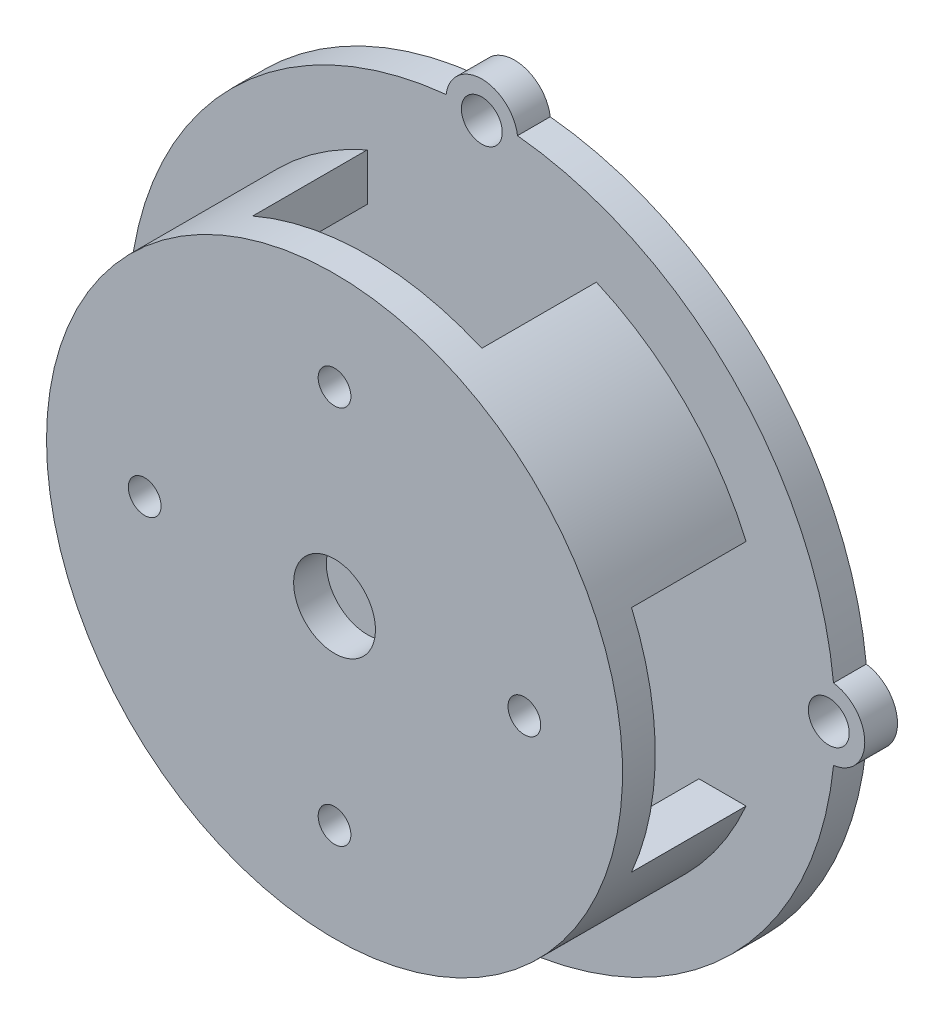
ISO-10303-21;
HEADER;
FILE_DESCRIPTION(('STEP AP214'),'2;1');
FILE_NAME('part.step','',(''),(''),'','','');
FILE_SCHEMA(('AUTOMOTIVE_DESIGN { 1 0 10303 214 1 1 1 1 }'));
ENDSEC;
DATA;
#1=APPLICATION_CONTEXT('core data for automotive mechanical design processes');
#2=APPLICATION_PROTOCOL_DEFINITION('international standard','automotive_design',2000,#1);
#3=PRODUCT_CONTEXT('',#1,'mechanical');
#4=PRODUCT('Part','Part','',(#3));
#5=PRODUCT_RELATED_PRODUCT_CATEGORY('part','',(#4));
#6=PRODUCT_DEFINITION_FORMATION('','',#4);
#7=PRODUCT_DEFINITION_CONTEXT('part definition',#1,'design');
#8=PRODUCT_DEFINITION('design','',#6,#7);
#9=PRODUCT_DEFINITION_SHAPE('','',#8);
#10=(LENGTH_UNIT() NAMED_UNIT(*) SI_UNIT(.MILLI.,.METRE.));
#11=(NAMED_UNIT(*) PLANE_ANGLE_UNIT() SI_UNIT($,.RADIAN.));
#12=(NAMED_UNIT(*) SI_UNIT($,.STERADIAN.) SOLID_ANGLE_UNIT());
#13=UNCERTAINTY_MEASURE_WITH_UNIT(LENGTH_MEASURE(1.E-05),#10,'distance_accuracy_value','');
#14=(GEOMETRIC_REPRESENTATION_CONTEXT(3) GLOBAL_UNCERTAINTY_ASSIGNED_CONTEXT((#13)) GLOBAL_UNIT_ASSIGNED_CONTEXT((#10,
#11,#12)) REPRESENTATION_CONTEXT('',''));
#15=CARTESIAN_POINT('',(0.,0.,0.));
#16=DIRECTION('',(0.,0.,1.));
#17=DIRECTION('',(1.,0.,0.));
#18=AXIS2_PLACEMENT_3D('',#15,#16,#17);
#19=CARTESIAN_POINT('',(0.,0.,0.));
#20=DIRECTION('',(0.,0.,1.));
#21=DIRECTION('',(1.,0.,0.));
#22=AXIS2_PLACEMENT_3D('',#19,#20,#21);
#23=PLANE('',#22);
#24=CARTESIAN_POINT('',(0.,0.,0.));
#25=DIRECTION('',(0.,0.,-1.));
#26=DIRECTION('',(-1.,0.,0.));
#27=AXIS2_PLACEMENT_3D('',#24,#25,#26);
#28=CIRCLE('',#27,85.);
#29=CARTESIAN_POINT('',(-85.,0.,0.));
#30=VERTEX_POINT('',#29);
#31=EDGE_CURVE('E491',#30,#30,#28,.T.);
#32=ORIENTED_EDGE('',*,*,#31,.T.);
#33=EDGE_LOOP('',(#32));
#34=FACE_BOUND('',#33,.T.);
#35=CARTESIAN_POINT('',(0.,0.,0.));
#36=DIRECTION('',(0.,0.,1.));
#37=DIRECTION('',(1.,0.,0.));
#38=AXIS2_PLACEMENT_3D('',#35,#36,#37);
#39=CIRCLE('',#38,17.5);
#40=CARTESIAN_POINT('',(17.5,0.,0.));
#41=VERTEX_POINT('',#40);
#42=EDGE_CURVE('E11',#41,#41,#39,.F.);
#43=ORIENTED_EDGE('',*,*,#42,.F.);
#44=EDGE_LOOP('',(#43));
#45=FACE_BOUND('',#44,.T.);
#46=ADVANCED_FACE('F30',(#34,#45),#23,.F.);
#47=CARTESIAN_POINT('',(106.,1.11029106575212E-12,0.));
#48=DIRECTION('',(0.,0.,-1.));
#49=DIRECTION('',(-1.,0.,0.));
#50=AXIS2_PLACEMENT_3D('',#47,#48,#49);
#51=CIRCLE('',#50,6.25);
#52=CARTESIAN_POINT('',(99.75,1.11029106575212E-12,0.));
#53=VERTEX_POINT('',#52);
#54=EDGE_CURVE('E235',#53,#53,#51,.T.);
#55=ORIENTED_EDGE('',*,*,#54,.F.);
#56=EDGE_LOOP('',(#55));
#57=FACE_BOUND('',#56,.T.);
#58=CARTESIAN_POINT('',(7.40194043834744E-13,-106.,0.));
#59=DIRECTION('',(0.,0.,-1.));
#60=DIRECTION('',(-1.,0.,0.));
#61=AXIS2_PLACEMENT_3D('',#58,#59,#60);
#62=CIRCLE('',#61,6.25);
#63=CARTESIAN_POINT('',(-6.24999999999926,-106.,0.));
#64=VERTEX_POINT('',#63);
#65=EDGE_CURVE('E241',#64,#64,#62,.T.);
#66=ORIENTED_EDGE('',*,*,#65,.F.);
#67=EDGE_LOOP('',(#66));
#68=FACE_BOUND('',#67,.T.);
#69=CARTESIAN_POINT('',(-106.,-3.70097021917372E-13,0.));
#70=DIRECTION('',(0.,0.,-1.));
#71=DIRECTION('',(-1.,0.,0.));
#72=AXIS2_PLACEMENT_3D('',#69,#70,#71);
#73=CIRCLE('',#72,6.25);
#74=CARTESIAN_POINT('',(-112.25,-3.70097021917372E-13,0.));
#75=VERTEX_POINT('',#74);
#76=EDGE_CURVE('E247',#75,#75,#73,.T.);
#77=ORIENTED_EDGE('',*,*,#76,.F.);
#78=EDGE_LOOP('',(#77));
#79=FACE_BOUND('',#78,.T.);
#80=CARTESIAN_POINT('',(0.,106.,0.));
#81=DIRECTION('',(0.,0.,-1.));
#82=DIRECTION('',(-1.,0.,0.));
#83=AXIS2_PLACEMENT_3D('',#80,#81,#82);
#84=CIRCLE('',#83,6.25);
#85=CARTESIAN_POINT('',(-6.25,106.,0.));
#86=VERTEX_POINT('',#85);
#87=EDGE_CURVE('E253',#86,#86,#84,.T.);
#88=ORIENTED_EDGE('',*,*,#87,.F.);
#89=EDGE_LOOP('',(#88));
#90=FACE_BOUND('',#89,.T.);
#91=CARTESIAN_POINT('',(0.,0.,0.));
#92=DIRECTION('',(0.,0.,1.));
#93=DIRECTION('',(1.,0.,0.));
#94=AXIS2_PLACEMENT_3D('',#91,#92,#93);
#95=CIRCLE('',#94,108.);
#96=CARTESIAN_POINT('',(107.448113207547,10.9042637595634,0.));
#97=VERTEX_POINT('',#96);
#98=CARTESIAN_POINT('',(10.9042637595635,107.448113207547,0.));
#99=VERTEX_POINT('',#98);
#100=EDGE_CURVE('E314',#97,#99,#95,.T.);
#101=ORIENTED_EDGE('',*,*,#100,.F.);
#102=CARTESIAN_POINT('',(106.,0.,0.));
#103=DIRECTION('',(0.,0.,-1.));
#104=DIRECTION('',(-1.,0.,0.));
#105=AXIS2_PLACEMENT_3D('',#102,#103,#104);
#106=CIRCLE('',#105,11.);
#107=CARTESIAN_POINT('',(107.448113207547,-10.9042637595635,0.));
#108=VERTEX_POINT('',#107);
#109=EDGE_CURVE('E259',#97,#108,#106,.T.);
#110=ORIENTED_EDGE('',*,*,#109,.T.);
#111=CARTESIAN_POINT('',(10.9042637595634,-107.448113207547,0.));
#112=VERTEX_POINT('',#111);
#113=EDGE_CURVE('E906',#112,#108,#95,.T.);
#114=ORIENTED_EDGE('',*,*,#113,.F.);
#115=CARTESIAN_POINT('',(0.,-106.,0.));
#116=DIRECTION('',(0.,0.,-1.));
#117=DIRECTION('',(-1.,0.,0.));
#118=AXIS2_PLACEMENT_3D('',#115,#116,#117);
#119=CIRCLE('',#118,11.);
#120=CARTESIAN_POINT('',(-10.9042637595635,-107.448113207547,0.));
#121=VERTEX_POINT('',#120);
#122=EDGE_CURVE('E270',#112,#121,#119,.T.);
#123=ORIENTED_EDGE('',*,*,#122,.T.);
#124=CARTESIAN_POINT('',(-107.448113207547,-10.9042637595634,0.));
#125=VERTEX_POINT('',#124);
#126=EDGE_CURVE('E320',#125,#121,#95,.T.);
#127=ORIENTED_EDGE('',*,*,#126,.F.);
#128=CARTESIAN_POINT('',(-106.,0.,0.));
#129=DIRECTION('',(0.,0.,-1.));
#130=DIRECTION('',(-1.,0.,0.));
#131=AXIS2_PLACEMENT_3D('',#128,#129,#130);
#132=CIRCLE('',#131,11.);
#133=CARTESIAN_POINT('',(-107.448113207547,10.9042637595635,0.));
#134=VERTEX_POINT('',#133);
#135=EDGE_CURVE('E281',#125,#134,#132,.T.);
#136=ORIENTED_EDGE('',*,*,#135,.T.);
#137=CARTESIAN_POINT('',(-10.9042637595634,107.448113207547,0.));
#138=VERTEX_POINT('',#137);
#139=EDGE_CURVE('E317',#138,#134,#95,.T.);
#140=ORIENTED_EDGE('',*,*,#139,.F.);
#141=CARTESIAN_POINT('',(0.,106.,0.));
#142=DIRECTION('',(0.,0.,-1.));
#143=DIRECTION('',(-1.,0.,0.));
#144=AXIS2_PLACEMENT_3D('',#141,#142,#143);
#145=CIRCLE('',#144,11.);
#146=EDGE_CURVE('E292',#138,#99,#145,.T.);
#147=ORIENTED_EDGE('',*,*,#146,.T.);
#148=EDGE_LOOP('',(#101,#110,#114,#123,#127,#136,#140,#147));
#149=FACE_BOUND('',#148,.T.);
#150=CARTESIAN_POINT('',(0.,0.,0.));
#151=DIRECTION('',(0.,0.,1.));
#152=DIRECTION('',(1.,0.,0.));
#153=AXIS2_PLACEMENT_3D('',#150,#151,#152);
#154=CIRCLE('',#153,92.5);
#155=CARTESIAN_POINT('',(92.5,0.,0.));
#156=VERTEX_POINT('',#155);
#157=EDGE_CURVE('E39',#156,#156,#154,.F.);
#158=ORIENTED_EDGE('',*,*,#157,.F.);
#159=EDGE_LOOP('',(#158));
#160=FACE_BOUND('',#159,.T.);
#161=ADVANCED_FACE('F327',(#57,#68,#79,#90,#149,#160),#23,.F.);
#162=CARTESIAN_POINT('',(0.,0.,0.));
#163=DIRECTION('',(0.,0.,-1.));
#164=DIRECTION('',(-1.,0.,0.));
#165=AXIS2_PLACEMENT_3D('',#162,#163,#164);
#166=CYLINDRICAL_SURFACE('',#165,88.);
#167=CARTESIAN_POINT('',(0.,0.,55.));
#168=DIRECTION('',(0.,0.,-1.));
#169=DIRECTION('',(-1.,0.,0.));
#170=AXIS2_PLACEMENT_3D('',#167,#168,#169);
#171=CIRCLE('',#170,88.);
#172=CARTESIAN_POINT('',(-88.,0.,55.));
#173=VERTEX_POINT('',#172);
#174=EDGE_CURVE('E303',#173,#173,#171,.T.);
#175=ORIENTED_EDGE('',*,*,#174,.T.);
#176=EDGE_LOOP('',(#175));
#177=FACE_BOUND('',#176,.T.);
#178=DIRECTION('',(0.,0.,-1.));
#179=VECTOR('',#178,1.);
#180=CARTESIAN_POINT('',(80.7403244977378,35.,0.));
#181=LINE('',#180,#179);
#182=CARTESIAN_POINT('',(80.7403244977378,35.,10.));
#183=VERTEX_POINT('',#182);
#184=CARTESIAN_POINT('',(80.7403244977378,35.,45.));
#185=VERTEX_POINT('',#184);
#186=EDGE_CURVE('E536',#183,#185,#181,.F.);
#187=ORIENTED_EDGE('',*,*,#186,.F.);
#188=CARTESIAN_POINT('',(0.,0.,10.));
#189=DIRECTION('',(0.,0.,-1.));
#190=DIRECTION('',(-1.,0.,0.));
#191=AXIS2_PLACEMENT_3D('',#188,#189,#190);
#192=CIRCLE('',#191,88.);
#193=CARTESIAN_POINT('',(35.,80.7403244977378,10.));
#194=VERTEX_POINT('',#193);
#195=EDGE_CURVE('E311',#194,#183,#192,.T.);
#196=ORIENTED_EDGE('',*,*,#195,.F.);
#197=DIRECTION('',(0.,0.,-1.));
#198=VECTOR('',#197,1.);
#199=CARTESIAN_POINT('',(35.,80.7403244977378,0.));
#200=LINE('',#199,#198);
#201=CARTESIAN_POINT('',(35.,80.7403244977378,45.));
#202=VERTEX_POINT('',#201);
#203=EDGE_CURVE('E545',#202,#194,#200,.T.);
#204=ORIENTED_EDGE('',*,*,#203,.F.);
#205=CARTESIAN_POINT('',(0.,0.,45.));
#206=DIRECTION('',(0.,0.,1.));
#207=DIRECTION('',(1.,0.,0.));
#208=AXIS2_PLACEMENT_3D('',#205,#206,#207);
#209=CIRCLE('',#208,88.);
#210=CARTESIAN_POINT('',(-35.,80.7403244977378,45.));
#211=VERTEX_POINT('',#210);
#212=EDGE_CURVE('E213',#211,#202,#209,.F.);
#213=ORIENTED_EDGE('',*,*,#212,.F.);
#214=DIRECTION('',(0.,0.,-1.));
#215=VECTOR('',#214,1.);
#216=CARTESIAN_POINT('',(-35.,80.7403244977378,0.));
#217=LINE('',#216,#215);
#218=CARTESIAN_POINT('',(-35.,80.7403244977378,10.));
#219=VERTEX_POINT('',#218);
#220=EDGE_CURVE('E232',#219,#211,#217,.F.);
#221=ORIENTED_EDGE('',*,*,#220,.F.);
#222=CARTESIAN_POINT('',(-80.7403244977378,35.,10.));
#223=VERTEX_POINT('',#222);
#224=EDGE_CURVE('E306',#223,#219,#192,.T.);
#225=ORIENTED_EDGE('',*,*,#224,.F.);
#226=DIRECTION('',(0.,0.,-1.));
#227=VECTOR('',#226,1.);
#228=CARTESIAN_POINT('',(-80.7403244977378,35.,0.));
#229=LINE('',#228,#227);
#230=CARTESIAN_POINT('',(-80.7403244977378,35.,45.));
#231=VERTEX_POINT('',#230);
#232=EDGE_CURVE('E538',#231,#223,#229,.T.);
#233=ORIENTED_EDGE('',*,*,#232,.F.);
#234=CARTESIAN_POINT('',(0.,0.,45.));
#235=DIRECTION('',(0.,0.,-1.));
#236=DIRECTION('',(0.,1.,0.));
#237=AXIS2_PLACEMENT_3D('',#234,#235,#236);
#238=CIRCLE('',#237,88.);
#239=CARTESIAN_POINT('',(-80.7403244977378,-35.,45.));
#240=VERTEX_POINT('',#239);
#241=EDGE_CURVE('E532',#240,#231,#238,.T.);
#242=ORIENTED_EDGE('',*,*,#241,.F.);
#243=DIRECTION('',(0.,0.,-1.));
#244=VECTOR('',#243,1.);
#245=CARTESIAN_POINT('',(-80.7403244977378,-35.,0.));
#246=LINE('',#245,#244);
#247=CARTESIAN_POINT('',(-80.7403244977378,-35.,10.));
#248=VERTEX_POINT('',#247);
#249=EDGE_CURVE('E527',#248,#240,#246,.F.);
#250=ORIENTED_EDGE('',*,*,#249,.F.);
#251=CARTESIAN_POINT('',(-35.,-80.7403244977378,10.));
#252=VERTEX_POINT('',#251);
#253=EDGE_CURVE('E307',#252,#248,#192,.T.);
#254=ORIENTED_EDGE('',*,*,#253,.F.);
#255=DIRECTION('',(0.,0.,-1.));
#256=VECTOR('',#255,1.);
#257=CARTESIAN_POINT('',(-35.,-80.7403244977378,0.));
#258=LINE('',#257,#256);
#259=CARTESIAN_POINT('',(-35.,-80.7403244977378,45.));
#260=VERTEX_POINT('',#259);
#261=EDGE_CURVE('E229',#260,#252,#258,.T.);
#262=ORIENTED_EDGE('',*,*,#261,.F.);
#263=CARTESIAN_POINT('',(35.,-80.7403244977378,45.));
#264=VERTEX_POINT('',#263);
#265=EDGE_CURVE('E541',#264,#260,#209,.F.);
#266=ORIENTED_EDGE('',*,*,#265,.F.);
#267=DIRECTION('',(0.,0.,-1.));
#268=VECTOR('',#267,1.);
#269=CARTESIAN_POINT('',(35.,-80.7403244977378,0.));
#270=LINE('',#269,#268);
#271=CARTESIAN_POINT('',(35.,-80.7403244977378,10.));
#272=VERTEX_POINT('',#271);
#273=EDGE_CURVE('E543',#272,#264,#270,.F.);
#274=ORIENTED_EDGE('',*,*,#273,.F.);
#275=CARTESIAN_POINT('',(80.7403244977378,-35.,10.));
#276=VERTEX_POINT('',#275);
#277=EDGE_CURVE('E310',#276,#272,#192,.T.);
#278=ORIENTED_EDGE('',*,*,#277,.F.);
#279=DIRECTION('',(0.,0.,-1.));
#280=VECTOR('',#279,1.);
#281=CARTESIAN_POINT('',(80.7403244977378,-35.,0.));
#282=LINE('',#281,#280);
#283=CARTESIAN_POINT('',(80.7403244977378,-35.,45.));
#284=VERTEX_POINT('',#283);
#285=EDGE_CURVE('E530',#284,#276,#282,.T.);
#286=ORIENTED_EDGE('',*,*,#285,.F.);
#287=EDGE_CURVE('E535',#185,#284,#238,.T.);
#288=ORIENTED_EDGE('',*,*,#287,.F.);
#289=EDGE_LOOP('',(#187,#196,#204,#213,#221,#225,#233,#242,#250,#254,#262,#266,#274,#278,#286,#288));
#290=FACE_BOUND('',#289,.T.);
#291=ADVANCED_FACE('F329',(#177,#290),#166,.T.);
#292=CARTESIAN_POINT('',(35.,-117.001,45.));
#293=DIRECTION('',(1.,0.,0.));
#294=DIRECTION('',(0.,0.,-1.));
#295=AXIS2_PLACEMENT_3D('',#292,#293,#294);
#296=PLANE('',#295);
#297=DIRECTION('',(0.,1.,0.));
#298=VECTOR('',#297,1.);
#299=CARTESIAN_POINT('',(35.,-117.001,10.));
#300=LINE('',#299,#298);
#301=CARTESIAN_POINT('',(35.,66.332495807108,9.99999999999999));
#302=VERTEX_POINT('',#301);
#303=EDGE_CURVE('E207',#302,#194,#300,.T.);
#304=ORIENTED_EDGE('',*,*,#303,.F.);
#305=DIRECTION('',(0.,0.,1.));
#306=VECTOR('',#305,1.);
#307=CARTESIAN_POINT('',(35.,66.332495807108,9.99999999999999));
#308=LINE('',#307,#306);
#309=CARTESIAN_POINT('',(35.,66.332495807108,45.));
#310=VERTEX_POINT('',#309);
#311=EDGE_CURVE('E192',#302,#310,#308,.T.);
#312=ORIENTED_EDGE('',*,*,#311,.T.);
#313=DIRECTION('',(0.,1.,0.));
#314=VECTOR('',#313,1.);
#315=CARTESIAN_POINT('',(35.,-117.001,45.));
#316=LINE('',#315,#314);
#317=EDGE_CURVE('E205',#310,#202,#316,.T.);
#318=ORIENTED_EDGE('',*,*,#317,.T.);
#319=ORIENTED_EDGE('',*,*,#203,.T.);
#320=EDGE_LOOP('',(#304,#312,#318,#319));
#321=FACE_BOUND('',#320,.T.);
#322=ADVANCED_FACE('F203',(#321),#296,.F.);
#323=CARTESIAN_POINT('',(35.,-66.332495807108,45.));
#324=VERTEX_POINT('',#323);
#325=EDGE_CURVE('E215',#264,#324,#316,.T.);
#326=ORIENTED_EDGE('',*,*,#325,.T.);
#327=DIRECTION('',(0.,0.,1.));
#328=VECTOR('',#327,1.);
#329=CARTESIAN_POINT('',(35.,-66.332495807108,9.99999999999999));
#330=LINE('',#329,#328);
#331=CARTESIAN_POINT('',(35.,-66.332495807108,9.99999999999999));
#332=VERTEX_POINT('',#331);
#333=EDGE_CURVE('E209',#324,#332,#330,.F.);
#334=ORIENTED_EDGE('',*,*,#333,.T.);
#335=EDGE_CURVE('E222',#272,#332,#300,.T.);
#336=ORIENTED_EDGE('',*,*,#335,.F.);
#337=ORIENTED_EDGE('',*,*,#273,.T.);
#338=EDGE_LOOP('',(#326,#334,#336,#337));
#339=FACE_BOUND('',#338,.T.);
#340=ADVANCED_FACE('F385',(#339),#296,.F.);
#341=CARTESIAN_POINT('',(-35.,-117.001,45.));
#342=DIRECTION('',(-1.,0.,0.));
#343=DIRECTION('',(0.,0.,1.));
#344=AXIS2_PLACEMENT_3D('',#341,#342,#343);
#345=PLANE('',#344);
#346=DIRECTION('',(0.,1.,0.));
#347=VECTOR('',#346,1.);
#348=CARTESIAN_POINT('',(-35.,-117.001,45.));
#349=LINE('',#348,#347);
#350=CARTESIAN_POINT('',(-35.,66.332495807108,45.));
#351=VERTEX_POINT('',#350);
#352=EDGE_CURVE('E219',#351,#211,#349,.T.);
#353=ORIENTED_EDGE('',*,*,#352,.F.);
#354=DIRECTION('',(0.,0.,1.));
#355=VECTOR('',#354,1.);
#356=CARTESIAN_POINT('',(-35.,66.332495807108,10.));
#357=LINE('',#356,#355);
#358=CARTESIAN_POINT('',(-35.,66.332495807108,9.99999999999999));
#359=VERTEX_POINT('',#358);
#360=EDGE_CURVE('E511',#351,#359,#357,.F.);
#361=ORIENTED_EDGE('',*,*,#360,.T.);
#362=DIRECTION('',(0.,1.,0.));
#363=VECTOR('',#362,1.);
#364=CARTESIAN_POINT('',(-35.,-117.001,10.));
#365=LINE('',#364,#363);
#366=EDGE_CURVE('E228',#359,#219,#365,.T.);
#367=ORIENTED_EDGE('',*,*,#366,.T.);
#368=ORIENTED_EDGE('',*,*,#220,.T.);
#369=EDGE_LOOP('',(#353,#361,#367,#368));
#370=FACE_BOUND('',#369,.T.);
#371=ADVANCED_FACE('F381',(#370),#345,.F.);
#372=CARTESIAN_POINT('',(-35.,-66.332495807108,9.99999999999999));
#373=VERTEX_POINT('',#372);
#374=EDGE_CURVE('E225',#252,#373,#365,.T.);
#375=ORIENTED_EDGE('',*,*,#374,.T.);
#376=DIRECTION('',(0.,0.,1.));
#377=VECTOR('',#376,1.);
#378=CARTESIAN_POINT('',(-35.,-66.332495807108,10.));
#379=LINE('',#378,#377);
#380=CARTESIAN_POINT('',(-35.,-66.332495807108,45.));
#381=VERTEX_POINT('',#380);
#382=EDGE_CURVE('E508',#373,#381,#379,.T.);
#383=ORIENTED_EDGE('',*,*,#382,.T.);
#384=EDGE_CURVE('E216',#260,#381,#349,.T.);
#385=ORIENTED_EDGE('',*,*,#384,.F.);
#386=ORIENTED_EDGE('',*,*,#261,.T.);
#387=EDGE_LOOP('',(#375,#383,#385,#386));
#388=FACE_BOUND('',#387,.T.);
#389=ADVANCED_FACE('F384',(#388),#345,.F.);
#390=CARTESIAN_POINT('',(0.,0.,55.));
#391=DIRECTION('',(0.,0.,-1.));
#392=DIRECTION('',(-1.,0.,0.));
#393=AXIS2_PLACEMENT_3D('',#390,#391,#392);
#394=CYLINDRICAL_SURFACE('',#393,108.);
#395=ORIENTED_EDGE('',*,*,#113,.T.);
#396=DIRECTION('',(0.,0.,-1.));
#397=VECTOR('',#396,1.);
#398=CARTESIAN_POINT('',(107.448113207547,-10.9042637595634,5.));
#399=LINE('',#398,#397);
#400=CARTESIAN_POINT('',(107.448113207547,-10.9042637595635,10.));
#401=VERTEX_POINT('',#400);
#402=EDGE_CURVE('E267',#108,#401,#399,.F.);
#403=ORIENTED_EDGE('',*,*,#402,.T.);
#404=CARTESIAN_POINT('',(0.,0.,10.));
#405=DIRECTION('',(0.,0.,-1.));
#406=DIRECTION('',(-1.,0.,0.));
#407=AXIS2_PLACEMENT_3D('',#404,#405,#406);
#408=CIRCLE('',#407,108.);
#409=CARTESIAN_POINT('',(10.9042637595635,-107.448113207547,10.));
#410=VERTEX_POINT('',#409);
#411=EDGE_CURVE('E315',#401,#410,#408,.T.);
#412=ORIENTED_EDGE('',*,*,#411,.T.);
#413=DIRECTION('',(0.,0.,-1.));
#414=VECTOR('',#413,1.);
#415=CARTESIAN_POINT('',(10.9042637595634,-107.448113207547,5.));
#416=LINE('',#415,#414);
#417=EDGE_CURVE('E274',#410,#112,#416,.T.);
#418=ORIENTED_EDGE('',*,*,#417,.T.);
#419=EDGE_LOOP('',(#395,#403,#412,#418));
#420=FACE_BOUND('',#419,.T.);
#421=ADVANCED_FACE('F772',(#420),#394,.T.);
#422=ORIENTED_EDGE('',*,*,#126,.T.);
#423=DIRECTION('',(0.,0.,-1.));
#424=VECTOR('',#423,1.);
#425=CARTESIAN_POINT('',(-10.9042637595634,-107.448113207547,5.));
#426=LINE('',#425,#424);
#427=CARTESIAN_POINT('',(-10.9042637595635,-107.448113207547,10.));
#428=VERTEX_POINT('',#427);
#429=EDGE_CURVE('E279',#121,#428,#426,.F.);
#430=ORIENTED_EDGE('',*,*,#429,.T.);
#431=CARTESIAN_POINT('',(-107.448113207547,-10.9042637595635,10.));
#432=VERTEX_POINT('',#431);
#433=EDGE_CURVE('E563',#428,#432,#408,.T.);
#434=ORIENTED_EDGE('',*,*,#433,.T.);
#435=DIRECTION('',(0.,0.,-1.));
#436=VECTOR('',#435,1.);
#437=CARTESIAN_POINT('',(-107.448113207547,-10.9042637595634,5.));
#438=LINE('',#437,#436);
#439=EDGE_CURVE('E284',#432,#125,#438,.T.);
#440=ORIENTED_EDGE('',*,*,#439,.T.);
#441=EDGE_LOOP('',(#422,#430,#434,#440));
#442=FACE_BOUND('',#441,.T.);
#443=ADVANCED_FACE('F838',(#442),#394,.T.);
#444=ORIENTED_EDGE('',*,*,#139,.T.);
#445=DIRECTION('',(0.,0.,-1.));
#446=VECTOR('',#445,1.);
#447=CARTESIAN_POINT('',(-107.448113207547,10.9042637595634,5.));
#448=LINE('',#447,#446);
#449=CARTESIAN_POINT('',(-107.448113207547,10.9042637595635,10.));
#450=VERTEX_POINT('',#449);
#451=EDGE_CURVE('E289',#134,#450,#448,.F.);
#452=ORIENTED_EDGE('',*,*,#451,.T.);
#453=CARTESIAN_POINT('',(-10.9042637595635,107.448113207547,10.));
#454=VERTEX_POINT('',#453);
#455=EDGE_CURVE('E316',#450,#454,#408,.T.);
#456=ORIENTED_EDGE('',*,*,#455,.T.);
#457=DIRECTION('',(0.,0.,-1.));
#458=VECTOR('',#457,1.);
#459=CARTESIAN_POINT('',(-10.9042637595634,107.448113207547,5.));
#460=LINE('',#459,#458);
#461=EDGE_CURVE('E296',#454,#138,#460,.T.);
#462=ORIENTED_EDGE('',*,*,#461,.T.);
#463=EDGE_LOOP('',(#444,#452,#456,#462));
#464=FACE_BOUND('',#463,.T.);
#465=ADVANCED_FACE('F828',(#464),#394,.T.);
#466=CARTESIAN_POINT('',(10.9042637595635,107.448113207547,10.));
#467=VERTEX_POINT('',#466);
#468=CARTESIAN_POINT('',(107.448113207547,10.9042637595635,10.));
#469=VERTEX_POINT('',#468);
#470=EDGE_CURVE('E312',#467,#469,#408,.T.);
#471=ORIENTED_EDGE('',*,*,#470,.T.);
#472=DIRECTION('',(0.,0.,-1.));
#473=VECTOR('',#472,1.);
#474=CARTESIAN_POINT('',(107.448113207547,10.9042637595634,5.));
#475=LINE('',#474,#473);
#476=EDGE_CURVE('E262',#469,#97,#475,.T.);
#477=ORIENTED_EDGE('',*,*,#476,.T.);
#478=ORIENTED_EDGE('',*,*,#100,.T.);
#479=DIRECTION('',(0.,0.,-1.));
#480=VECTOR('',#479,1.);
#481=CARTESIAN_POINT('',(10.9042637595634,107.448113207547,5.));
#482=LINE('',#481,#480);
#483=EDGE_CURVE('E301',#99,#467,#482,.F.);
#484=ORIENTED_EDGE('',*,*,#483,.T.);
#485=EDGE_LOOP('',(#471,#477,#478,#484));
#486=FACE_BOUND('',#485,.T.);
#487=ADVANCED_FACE('F32',(#486),#394,.T.);
#488=CARTESIAN_POINT('',(-108.,0.,10.));
#489=DIRECTION('',(0.,0.,-1.));
#490=DIRECTION('',(-1.,0.,0.));
#491=AXIS2_PLACEMENT_3D('',#488,#489,#490);
#492=PLANE('',#491);
#493=CARTESIAN_POINT('',(0.,0.,10.));
#494=DIRECTION('',(0.,0.,-1.));
#495=DIRECTION('',(-1.,0.,0.));
#496=AXIS2_PLACEMENT_3D('',#493,#494,#495);
#497=CIRCLE('',#496,12.5);
#498=CARTESIAN_POINT('',(-12.5,0.,10.));
#499=VERTEX_POINT('',#498);
#500=EDGE_CURVE('E482',#499,#499,#497,.T.);
#501=ORIENTED_EDGE('',*,*,#500,.T.);
#502=EDGE_LOOP('',(#501));
#503=FACE_BOUND('',#502,.T.);
#504=CARTESIAN_POINT('',(0.,0.,9.99999999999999));
#505=DIRECTION('',(0.,0.,1.));
#506=DIRECTION('',(1.,0.,0.));
#507=AXIS2_PLACEMENT_3D('',#504,#505,#506);
#508=CIRCLE('',#507,75.);
#509=CARTESIAN_POINT('',(66.332495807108,35.,9.99999999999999));
#510=VERTEX_POINT('',#509);
#511=EDGE_CURVE('E500',#510,#302,#508,.T.);
#512=ORIENTED_EDGE('',*,*,#511,.T.);
#513=ORIENTED_EDGE('',*,*,#303,.T.);
#514=ORIENTED_EDGE('',*,*,#195,.T.);
#515=DIRECTION('',(-1.,0.,0.));
#516=VECTOR('',#515,1.);
#517=CARTESIAN_POINT('',(108.,35.,10.));
#518=LINE('',#517,#516);
#519=EDGE_CURVE('E526',#183,#510,#518,.T.);
#520=ORIENTED_EDGE('',*,*,#519,.T.);
#521=EDGE_LOOP('',(#512,#513,#514,#520));
#522=FACE_BOUND('',#521,.T.);
#523=ORIENTED_EDGE('',*,*,#335,.T.);
#524=CARTESIAN_POINT('',(66.332495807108,-35.,9.99999999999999));
#525=VERTEX_POINT('',#524);
#526=EDGE_CURVE('E197',#332,#525,#508,.T.);
#527=ORIENTED_EDGE('',*,*,#526,.T.);
#528=DIRECTION('',(-1.,0.,0.));
#529=VECTOR('',#528,1.);
#530=CARTESIAN_POINT('',(108.,-35.,10.));
#531=LINE('',#530,#529);
#532=EDGE_CURVE('E517',#276,#525,#531,.T.);
#533=ORIENTED_EDGE('',*,*,#532,.F.);
#534=ORIENTED_EDGE('',*,*,#277,.T.);
#535=EDGE_LOOP('',(#523,#527,#533,#534));
#536=FACE_BOUND('',#535,.T.);
#537=ORIENTED_EDGE('',*,*,#366,.F.);
#538=CARTESIAN_POINT('',(-66.332495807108,35.,9.99999999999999));
#539=VERTEX_POINT('',#538);
#540=EDGE_CURVE('E501',#359,#539,#508,.T.);
#541=ORIENTED_EDGE('',*,*,#540,.T.);
#542=EDGE_CURVE('E524',#539,#223,#518,.T.);
#543=ORIENTED_EDGE('',*,*,#542,.T.);
#544=ORIENTED_EDGE('',*,*,#224,.T.);
#545=EDGE_LOOP('',(#537,#541,#543,#544));
#546=FACE_BOUND('',#545,.T.);
#547=CARTESIAN_POINT('',(-66.332495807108,-35.,9.99999999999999));
#548=VERTEX_POINT('',#547);
#549=EDGE_CURVE('E582',#548,#373,#508,.T.);
#550=ORIENTED_EDGE('',*,*,#549,.T.);
#551=ORIENTED_EDGE('',*,*,#374,.F.);
#552=ORIENTED_EDGE('',*,*,#253,.T.);
#553=EDGE_CURVE('E208',#548,#248,#531,.T.);
#554=ORIENTED_EDGE('',*,*,#553,.F.);
#555=EDGE_LOOP('',(#550,#551,#552,#554));
#556=FACE_BOUND('',#555,.T.);
#557=CARTESIAN_POINT('',(106.,1.11029106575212E-12,10.));
#558=DIRECTION('',(0.,0.,-1.));
#559=DIRECTION('',(-1.,0.,0.));
#560=AXIS2_PLACEMENT_3D('',#557,#558,#559);
#561=CIRCLE('',#560,6.25);
#562=CARTESIAN_POINT('',(99.75,1.11029106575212E-12,10.));
#563=VERTEX_POINT('',#562);
#564=EDGE_CURVE('E238',#563,#563,#561,.F.);
#565=ORIENTED_EDGE('',*,*,#564,.F.);
#566=EDGE_LOOP('',(#565));
#567=FACE_BOUND('',#566,.T.);
#568=ORIENTED_EDGE('',*,*,#411,.F.);
#569=CARTESIAN_POINT('',(106.,0.,10.));
#570=DIRECTION('',(0.,0.,-1.));
#571=DIRECTION('',(-1.,0.,0.));
#572=AXIS2_PLACEMENT_3D('',#569,#570,#571);
#573=CIRCLE('',#572,11.);
#574=EDGE_CURVE('E260',#469,#401,#573,.T.);
#575=ORIENTED_EDGE('',*,*,#574,.F.);
#576=ORIENTED_EDGE('',*,*,#470,.F.);
#577=CARTESIAN_POINT('',(0.,106.,10.));
#578=DIRECTION('',(0.,0.,-1.));
#579=DIRECTION('',(-1.,0.,0.));
#580=AXIS2_PLACEMENT_3D('',#577,#578,#579);
#581=CIRCLE('',#580,11.);
#582=EDGE_CURVE('E293',#454,#467,#581,.T.);
#583=ORIENTED_EDGE('',*,*,#582,.F.);
#584=ORIENTED_EDGE('',*,*,#455,.F.);
#585=CARTESIAN_POINT('',(-106.,0.,10.));
#586=DIRECTION('',(0.,0.,-1.));
#587=DIRECTION('',(-1.,0.,0.));
#588=AXIS2_PLACEMENT_3D('',#585,#586,#587);
#589=CIRCLE('',#588,11.);
#590=EDGE_CURVE('E282',#432,#450,#589,.T.);
#591=ORIENTED_EDGE('',*,*,#590,.F.);
#592=ORIENTED_EDGE('',*,*,#433,.F.);
#593=CARTESIAN_POINT('',(0.,-106.,10.));
#594=DIRECTION('',(0.,0.,-1.));
#595=DIRECTION('',(-1.,0.,0.));
#596=AXIS2_PLACEMENT_3D('',#593,#594,#595);
#597=CIRCLE('',#596,11.);
#598=EDGE_CURVE('E271',#410,#428,#597,.T.);
#599=ORIENTED_EDGE('',*,*,#598,.F.);
#600=EDGE_LOOP('',(#568,#575,#576,#583,#584,#591,#592,#599));
#601=FACE_BOUND('',#600,.T.);
#602=CARTESIAN_POINT('',(-106.,-3.70097021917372E-13,10.));
#603=DIRECTION('',(0.,0.,-1.));
#604=DIRECTION('',(-1.,0.,0.));
#605=AXIS2_PLACEMENT_3D('',#602,#603,#604);
#606=CIRCLE('',#605,6.25);
#607=CARTESIAN_POINT('',(-112.25,-3.70097021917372E-13,10.));
#608=VERTEX_POINT('',#607);
#609=EDGE_CURVE('E250',#608,#608,#606,.F.);
#610=ORIENTED_EDGE('',*,*,#609,.F.);
#611=EDGE_LOOP('',(#610));
#612=FACE_BOUND('',#611,.T.);
#613=CARTESIAN_POINT('',(7.40194043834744E-13,-106.,10.));
#614=DIRECTION('',(0.,0.,-1.));
#615=DIRECTION('',(-1.,0.,0.));
#616=AXIS2_PLACEMENT_3D('',#613,#614,#615);
#617=CIRCLE('',#616,6.25);
#618=CARTESIAN_POINT('',(-6.24999999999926,-106.,10.));
#619=VERTEX_POINT('',#618);
#620=EDGE_CURVE('E244',#619,#619,#617,.F.);
#621=ORIENTED_EDGE('',*,*,#620,.F.);
#622=EDGE_LOOP('',(#621));
#623=FACE_BOUND('',#622,.T.);
#624=CARTESIAN_POINT('',(0.,106.,10.));
#625=DIRECTION('',(0.,0.,-1.));
#626=DIRECTION('',(-1.,0.,0.));
#627=AXIS2_PLACEMENT_3D('',#624,#625,#626);
#628=CIRCLE('',#627,6.25);
#629=CARTESIAN_POINT('',(-6.25,106.,10.));
#630=VERTEX_POINT('',#629);
#631=EDGE_CURVE('E256',#630,#630,#628,.F.);
#632=ORIENTED_EDGE('',*,*,#631,.F.);
#633=EDGE_LOOP('',(#632));
#634=FACE_BOUND('',#633,.T.);
#635=ADVANCED_FACE('F345',(#503,#522,#536,#546,#556,#567,#601,#612,#623,#634),#492,.F.);
#636=CARTESIAN_POINT('',(0.,0.,55.));
#637=DIRECTION('',(0.,0.,1.));
#638=DIRECTION('',(1.,0.,0.));
#639=AXIS2_PLACEMENT_3D('',#636,#637,#638);
#640=PLANE('',#639);
#641=CARTESIAN_POINT('',(-58.,0.,55.));
#642=DIRECTION('',(0.,0.,1.));
#643=DIRECTION('',(1.,0.,0.));
#644=AXIS2_PLACEMENT_3D('',#641,#642,#643);
#645=CIRCLE('',#644,5.);
#646=CARTESIAN_POINT('',(-53.,0.,55.));
#647=VERTEX_POINT('',#646);
#648=EDGE_CURVE('E457',#647,#647,#645,.T.);
#649=ORIENTED_EDGE('',*,*,#648,.F.);
#650=EDGE_LOOP('',(#649));
#651=FACE_BOUND('',#650,.T.);
#652=CARTESIAN_POINT('',(0.,-58.,55.));
#653=DIRECTION('',(0.,0.,1.));
#654=DIRECTION('',(1.,0.,0.));
#655=AXIS2_PLACEMENT_3D('',#652,#653,#654);
#656=CIRCLE('',#655,5.00000000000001);
#657=CARTESIAN_POINT('',(5.00000000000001,-58.,55.));
#658=VERTEX_POINT('',#657);
#659=EDGE_CURVE('E459',#658,#658,#656,.T.);
#660=ORIENTED_EDGE('',*,*,#659,.F.);
#661=EDGE_LOOP('',(#660));
#662=FACE_BOUND('',#661,.T.);
#663=CARTESIAN_POINT('',(58.,0.,55.));
#664=DIRECTION('',(0.,0.,1.));
#665=DIRECTION('',(1.,0.,0.));
#666=AXIS2_PLACEMENT_3D('',#663,#664,#665);
#667=CIRCLE('',#666,5.);
#668=CARTESIAN_POINT('',(63.,0.,55.));
#669=VERTEX_POINT('',#668);
#670=EDGE_CURVE('E465',#669,#669,#667,.T.);
#671=ORIENTED_EDGE('',*,*,#670,.F.);
#672=EDGE_LOOP('',(#671));
#673=FACE_BOUND('',#672,.T.);
#674=CARTESIAN_POINT('',(0.,58.,55.));
#675=DIRECTION('',(0.,0.,1.));
#676=DIRECTION('',(1.,0.,0.));
#677=AXIS2_PLACEMENT_3D('',#674,#675,#676);
#678=CIRCLE('',#677,5.00000000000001);
#679=CARTESIAN_POINT('',(5.00000000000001,58.,55.));
#680=VERTEX_POINT('',#679);
#681=EDGE_CURVE('E471',#680,#680,#678,.T.);
#682=ORIENTED_EDGE('',*,*,#681,.F.);
#683=EDGE_LOOP('',(#682));
#684=FACE_BOUND('',#683,.T.);
#685=CARTESIAN_POINT('',(0.,0.,55.));
#686=DIRECTION('',(0.,0.,-1.));
#687=DIRECTION('',(-1.,0.,0.));
#688=AXIS2_PLACEMENT_3D('',#685,#686,#687);
#689=CIRCLE('',#688,12.5);
#690=CARTESIAN_POINT('',(-12.5,0.,55.));
#691=VERTEX_POINT('',#690);
#692=EDGE_CURVE('E477',#691,#691,#689,.T.);
#693=ORIENTED_EDGE('',*,*,#692,.T.);
#694=EDGE_LOOP('',(#693));
#695=FACE_BOUND('',#694,.T.);
#696=ORIENTED_EDGE('',*,*,#174,.F.);
#697=EDGE_LOOP('',(#696));
#698=FACE_BOUND('',#697,.T.);
#699=ADVANCED_FACE('F341',(#651,#662,#673,#684,#695,#698),#640,.T.);
#700=CARTESIAN_POINT('',(0.,106.,10.));
#701=DIRECTION('',(0.,0.,-1.));
#702=DIRECTION('',(-1.,0.,0.));
#703=AXIS2_PLACEMENT_3D('',#700,#701,#702);
#704=CYLINDRICAL_SURFACE('',#703,11.);
#705=ORIENTED_EDGE('',*,*,#483,.F.);
#706=ORIENTED_EDGE('',*,*,#146,.F.);
#707=ORIENTED_EDGE('',*,*,#461,.F.);
#708=ORIENTED_EDGE('',*,*,#582,.T.);
#709=EDGE_LOOP('',(#705,#706,#707,#708));
#710=FACE_BOUND('',#709,.T.);
#711=ADVANCED_FACE('F344',(#710),#704,.T.);
#712=CARTESIAN_POINT('',(-106.,0.,10.));
#713=DIRECTION('',(0.,0.,-1.));
#714=DIRECTION('',(-1.,0.,0.));
#715=AXIS2_PLACEMENT_3D('',#712,#713,#714);
#716=CYLINDRICAL_SURFACE('',#715,11.);
#717=ORIENTED_EDGE('',*,*,#451,.F.);
#718=ORIENTED_EDGE('',*,*,#135,.F.);
#719=ORIENTED_EDGE('',*,*,#439,.F.);
#720=ORIENTED_EDGE('',*,*,#590,.T.);
#721=EDGE_LOOP('',(#717,#718,#719,#720));
#722=FACE_BOUND('',#721,.T.);
#723=ADVANCED_FACE('F352',(#722),#716,.T.);
#724=CARTESIAN_POINT('',(0.,-106.,10.));
#725=DIRECTION('',(0.,0.,-1.));
#726=DIRECTION('',(-1.,0.,0.));
#727=AXIS2_PLACEMENT_3D('',#724,#725,#726);
#728=CYLINDRICAL_SURFACE('',#727,11.);
#729=ORIENTED_EDGE('',*,*,#429,.F.);
#730=ORIENTED_EDGE('',*,*,#122,.F.);
#731=ORIENTED_EDGE('',*,*,#417,.F.);
#732=ORIENTED_EDGE('',*,*,#598,.T.);
#733=EDGE_LOOP('',(#729,#730,#731,#732));
#734=FACE_BOUND('',#733,.T.);
#735=ADVANCED_FACE('F356',(#734),#728,.T.);
#736=CARTESIAN_POINT('',(106.,0.,10.));
#737=DIRECTION('',(0.,0.,-1.));
#738=DIRECTION('',(-1.,0.,0.));
#739=AXIS2_PLACEMENT_3D('',#736,#737,#738);
#740=CYLINDRICAL_SURFACE('',#739,11.);
#741=ORIENTED_EDGE('',*,*,#402,.F.);
#742=ORIENTED_EDGE('',*,*,#109,.F.);
#743=ORIENTED_EDGE('',*,*,#476,.F.);
#744=ORIENTED_EDGE('',*,*,#574,.T.);
#745=EDGE_LOOP('',(#741,#742,#743,#744));
#746=FACE_BOUND('',#745,.T.);
#747=ADVANCED_FACE('F360',(#746),#740,.T.);
#748=CARTESIAN_POINT('',(0.,106.,55.001));
#749=DIRECTION('',(0.,0.,-1.));
#750=DIRECTION('',(-1.,0.,0.));
#751=AXIS2_PLACEMENT_3D('',#748,#749,#750);
#752=CYLINDRICAL_SURFACE('',#751,6.25);
#753=CARTESIAN_POINT('',(-6.25,106.,0.));
#754=CARTESIAN_POINT('',(-6.25,106.,0.104166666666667));
#755=CARTESIAN_POINT('',(-6.25,106.,0.208333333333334));
#756=CARTESIAN_POINT('',(-6.25,106.,0.416666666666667));
#757=CARTESIAN_POINT('',(-6.25,106.,0.520833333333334));
#758=CARTESIAN_POINT('',(-6.25,106.,0.729166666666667));
#759=CARTESIAN_POINT('',(-6.25,106.,0.833333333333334));
#760=CARTESIAN_POINT('',(-6.25,106.,1.04166666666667));
#761=CARTESIAN_POINT('',(-6.25,106.,1.14583333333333));
#762=CARTESIAN_POINT('',(-6.25,106.,1.35416666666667));
#763=CARTESIAN_POINT('',(-6.25,106.,1.45833333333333));
#764=CARTESIAN_POINT('',(-6.25,106.,1.66666666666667));
#765=CARTESIAN_POINT('',(-6.25,106.,1.77083333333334));
#766=CARTESIAN_POINT('',(-6.25,106.,1.97916666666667));
#767=CARTESIAN_POINT('',(-6.25,106.,2.08333333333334));
#768=CARTESIAN_POINT('',(-6.25,106.,2.29166666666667));
#769=CARTESIAN_POINT('',(-6.25,106.,2.39583333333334));
#770=CARTESIAN_POINT('',(-6.25,106.,2.60416666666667));
#771=CARTESIAN_POINT('',(-6.25,106.,2.70833333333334));
#772=CARTESIAN_POINT('',(-6.25,106.,2.91666666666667));
#773=CARTESIAN_POINT('',(-6.25,106.,3.02083333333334));
#774=CARTESIAN_POINT('',(-6.25,106.,3.22916666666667));
#775=CARTESIAN_POINT('',(-6.25,106.,3.33333333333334));
#776=CARTESIAN_POINT('',(-6.25,106.,3.54166666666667));
#777=CARTESIAN_POINT('',(-6.25,106.,3.64583333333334));
#778=CARTESIAN_POINT('',(-6.25,106.,3.85416666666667));
#779=CARTESIAN_POINT('',(-6.25,106.,3.95833333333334));
#780=CARTESIAN_POINT('',(-6.25,106.,4.16666666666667));
#781=CARTESIAN_POINT('',(-6.25,106.,4.27083333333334));
#782=CARTESIAN_POINT('',(-6.25,106.,4.47916666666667));
#783=CARTESIAN_POINT('',(-6.25,106.,4.58333333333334));
#784=CARTESIAN_POINT('',(-6.25,106.,4.79166666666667));
#785=CARTESIAN_POINT('',(-6.25,106.,4.89583333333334));
#786=CARTESIAN_POINT('',(-6.25,106.,5.10416666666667));
#787=CARTESIAN_POINT('',(-6.25,106.,5.20833333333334));
#788=CARTESIAN_POINT('',(-6.25,106.,5.41666666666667));
#789=CARTESIAN_POINT('',(-6.25,106.,5.52083333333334));
#790=CARTESIAN_POINT('',(-6.25,106.,5.72916666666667));
#791=CARTESIAN_POINT('',(-6.25,106.,5.83333333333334));
#792=CARTESIAN_POINT('',(-6.25,106.,6.04166666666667));
#793=CARTESIAN_POINT('',(-6.25,106.,6.14583333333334));
#794=CARTESIAN_POINT('',(-6.25,106.,6.35416666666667));
#795=CARTESIAN_POINT('',(-6.25,106.,6.45833333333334));
#796=CARTESIAN_POINT('',(-6.25,106.,6.66666666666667));
#797=CARTESIAN_POINT('',(-6.25,106.,6.77083333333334));
#798=CARTESIAN_POINT('',(-6.25,106.,6.97916666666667));
#799=CARTESIAN_POINT('',(-6.25,106.,7.08333333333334));
#800=CARTESIAN_POINT('',(-6.25,106.,7.29166666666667));
#801=CARTESIAN_POINT('',(-6.25,106.,7.39583333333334));
#802=CARTESIAN_POINT('',(-6.25,106.,7.60416666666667));
#803=CARTESIAN_POINT('',(-6.25,106.,7.70833333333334));
#804=CARTESIAN_POINT('',(-6.25,106.,7.91666666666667));
#805=CARTESIAN_POINT('',(-6.25,106.,8.02083333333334));
#806=CARTESIAN_POINT('',(-6.25,106.,8.22916666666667));
#807=CARTESIAN_POINT('',(-6.25,106.,8.33333333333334));
#808=CARTESIAN_POINT('',(-6.25,106.,8.54166666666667));
#809=CARTESIAN_POINT('',(-6.25,106.,8.64583333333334));
#810=CARTESIAN_POINT('',(-6.25,106.,8.85416666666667));
#811=CARTESIAN_POINT('',(-6.25,106.,8.95833333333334));
#812=CARTESIAN_POINT('',(-6.25,106.,9.16666666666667));
#813=CARTESIAN_POINT('',(-6.25,106.,9.27083333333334));
#814=CARTESIAN_POINT('',(-6.25,106.,9.47916666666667));
#815=CARTESIAN_POINT('',(-6.25,106.,9.58333333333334));
#816=CARTESIAN_POINT('',(-6.25,106.,9.79166666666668));
#817=CARTESIAN_POINT('',(-6.25,106.,9.89583333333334));
#818=CARTESIAN_POINT('',(-6.25,106.,10.));
#819=B_SPLINE_CURVE_WITH_KNOTS('',3,(#753,#754,#755,#756,#757,#758,#759,#760,#761,#762,#763,
#764,#765,#766,#767,#768,#769,#770,#771,#772,#773,#774,#775,#776,#777,#778,#779,#780,#781,#782,
#783,#784,#785,#786,#787,#788,#789,#790,#791,#792,#793,#794,#795,#796,#797,#798,#799,#800,#801,
#802,#803,#804,#805,#806,#807,#808,#809,#810,#811,#812,#813,#814,#815,#816,#817,#818),
.UNSPECIFIED.,.F.,.F.,(4,2,2,2,2,2,2,2,2,2,2,2,2,2,2,2,2,2,2,2,2,2,2,2,2,2,2,2,2,2,2,2,4),(0.,
0.3125,0.625000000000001,0.937500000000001,1.25,1.5625,1.875,2.1875,2.5,2.8125,3.125,3.4375,
3.75,4.0625,4.375,4.6875,5.,5.3125,5.62500000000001,5.93750000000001,6.25000000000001,
6.56250000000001,6.87500000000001,7.18750000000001,7.50000000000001,7.81250000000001,
8.12500000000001,8.43750000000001,8.75000000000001,9.06250000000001,9.37500000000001,
9.68750000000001,10.),.UNSPECIFIED.);
#820=EDGE_CURVE('BSEAM364',#86,#630,#819,.T.);
#821=ORIENTED_EDGE('',*,*,#87,.T.);
#822=ORIENTED_EDGE('',*,*,#631,.T.);
#823=ORIENTED_EDGE('',*,*,#820,.T.);
#824=ORIENTED_EDGE('',*,*,#820,.F.);
#825=EDGE_LOOP('',(#821,#823,#822,#824));
#826=FACE_BOUND('',#825,.T.);
#827=ADVANCED_FACE('F364',(#826),#752,.F.);
#828=CARTESIAN_POINT('',(-106.,-3.70097021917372E-13,55.001));
#829=DIRECTION('',(0.,0.,-1.));
#830=DIRECTION('',(-1.,0.,0.));
#831=AXIS2_PLACEMENT_3D('',#828,#829,#830);
#832=CYLINDRICAL_SURFACE('',#831,6.25);
#833=CARTESIAN_POINT('',(-112.25,-3.70097021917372E-13,0.));
#834=CARTESIAN_POINT('',(-112.25,-3.70097021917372E-13,0.104166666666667));
#835=CARTESIAN_POINT('',(-112.25,-3.70097021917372E-13,0.208333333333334));
#836=CARTESIAN_POINT('',(-112.25,-3.70097021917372E-13,0.416666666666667));
#837=CARTESIAN_POINT('',(-112.25,-3.70097021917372E-13,0.520833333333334));
#838=CARTESIAN_POINT('',(-112.25,-3.70097021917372E-13,0.729166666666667));
#839=CARTESIAN_POINT('',(-112.25,-3.70097021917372E-13,0.833333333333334));
#840=CARTESIAN_POINT('',(-112.25,-3.70097021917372E-13,1.04166666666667));
#841=CARTESIAN_POINT('',(-112.25,-3.70097021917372E-13,1.14583333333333));
#842=CARTESIAN_POINT('',(-112.25,-3.70097021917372E-13,1.35416666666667));
#843=CARTESIAN_POINT('',(-112.25,-3.70097021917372E-13,1.45833333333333));
#844=CARTESIAN_POINT('',(-112.25,-3.70097021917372E-13,1.66666666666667));
#845=CARTESIAN_POINT('',(-112.25,-3.70097021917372E-13,1.77083333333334));
#846=CARTESIAN_POINT('',(-112.25,-3.70097021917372E-13,1.97916666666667));
#847=CARTESIAN_POINT('',(-112.25,-3.70097021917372E-13,2.08333333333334));
#848=CARTESIAN_POINT('',(-112.25,-3.70097021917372E-13,2.29166666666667));
#849=CARTESIAN_POINT('',(-112.25,-3.70097021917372E-13,2.39583333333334));
#850=CARTESIAN_POINT('',(-112.25,-3.70097021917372E-13,2.60416666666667));
#851=CARTESIAN_POINT('',(-112.25,-3.70097021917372E-13,2.70833333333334));
#852=CARTESIAN_POINT('',(-112.25,-3.70097021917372E-13,2.91666666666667));
#853=CARTESIAN_POINT('',(-112.25,-3.70097021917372E-13,3.02083333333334));
#854=CARTESIAN_POINT('',(-112.25,-3.70097021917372E-13,3.22916666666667));
#855=CARTESIAN_POINT('',(-112.25,-3.70097021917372E-13,3.33333333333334));
#856=CARTESIAN_POINT('',(-112.25,-3.70097021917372E-13,3.54166666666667));
#857=CARTESIAN_POINT('',(-112.25,-3.70097021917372E-13,3.64583333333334));
#858=CARTESIAN_POINT('',(-112.25,-3.70097021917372E-13,3.85416666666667));
#859=CARTESIAN_POINT('',(-112.25,-3.70097021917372E-13,3.95833333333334));
#860=CARTESIAN_POINT('',(-112.25,-3.70097021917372E-13,4.16666666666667));
#861=CARTESIAN_POINT('',(-112.25,-3.70097021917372E-13,4.27083333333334));
#862=CARTESIAN_POINT('',(-112.25,-3.70097021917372E-13,4.47916666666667));
#863=CARTESIAN_POINT('',(-112.25,-3.70097021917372E-13,4.58333333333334));
#864=CARTESIAN_POINT('',(-112.25,-3.70097021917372E-13,4.79166666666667));
#865=CARTESIAN_POINT('',(-112.25,-3.70097021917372E-13,4.89583333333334));
#866=CARTESIAN_POINT('',(-112.25,-3.70097021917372E-13,5.10416666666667));
#867=CARTESIAN_POINT('',(-112.25,-3.70097021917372E-13,5.20833333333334));
#868=CARTESIAN_POINT('',(-112.25,-3.70097021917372E-13,5.41666666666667));
#869=CARTESIAN_POINT('',(-112.25,-3.70097021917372E-13,5.52083333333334));
#870=CARTESIAN_POINT('',(-112.25,-3.70097021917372E-13,5.72916666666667));
#871=CARTESIAN_POINT('',(-112.25,-3.70097021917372E-13,5.83333333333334));
#872=CARTESIAN_POINT('',(-112.25,-3.70097021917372E-13,6.04166666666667));
#873=CARTESIAN_POINT('',(-112.25,-3.70097021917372E-13,6.14583333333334));
#874=CARTESIAN_POINT('',(-112.25,-3.70097021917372E-13,6.35416666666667));
#875=CARTESIAN_POINT('',(-112.25,-3.70097021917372E-13,6.45833333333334));
#876=CARTESIAN_POINT('',(-112.25,-3.70097021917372E-13,6.66666666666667));
#877=CARTESIAN_POINT('',(-112.25,-3.70097021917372E-13,6.77083333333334));
#878=CARTESIAN_POINT('',(-112.25,-3.70097021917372E-13,6.97916666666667));
#879=CARTESIAN_POINT('',(-112.25,-3.70097021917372E-13,7.08333333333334));
#880=CARTESIAN_POINT('',(-112.25,-3.70097021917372E-13,7.29166666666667));
#881=CARTESIAN_POINT('',(-112.25,-3.70097021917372E-13,7.39583333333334));
#882=CARTESIAN_POINT('',(-112.25,-3.70097021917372E-13,7.60416666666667));
#883=CARTESIAN_POINT('',(-112.25,-3.70097021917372E-13,7.70833333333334));
#884=CARTESIAN_POINT('',(-112.25,-3.70097021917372E-13,7.91666666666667));
#885=CARTESIAN_POINT('',(-112.25,-3.70097021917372E-13,8.02083333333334));
#886=CARTESIAN_POINT('',(-112.25,-3.70097021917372E-13,8.22916666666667));
#887=CARTESIAN_POINT('',(-112.25,-3.70097021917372E-13,8.33333333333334));
#888=CARTESIAN_POINT('',(-112.25,-3.70097021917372E-13,8.54166666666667));
#889=CARTESIAN_POINT('',(-112.25,-3.70097021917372E-13,8.64583333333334));
#890=CARTESIAN_POINT('',(-112.25,-3.70097021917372E-13,8.85416666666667));
#891=CARTESIAN_POINT('',(-112.25,-3.70097021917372E-13,8.95833333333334));
#892=CARTESIAN_POINT('',(-112.25,-3.70097021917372E-13,9.16666666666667));
#893=CARTESIAN_POINT('',(-112.25,-3.70097021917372E-13,9.27083333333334));
#894=CARTESIAN_POINT('',(-112.25,-3.70097021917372E-13,9.47916666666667));
#895=CARTESIAN_POINT('',(-112.25,-3.70097021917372E-13,9.58333333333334));
#896=CARTESIAN_POINT('',(-112.25,-3.70097021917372E-13,9.79166666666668));
#897=CARTESIAN_POINT('',(-112.25,-3.70097021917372E-13,9.89583333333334));
#898=CARTESIAN_POINT('',(-112.25,-3.70097021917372E-13,10.));
#899=B_SPLINE_CURVE_WITH_KNOTS('',3,(#833,#834,#835,#836,#837,#838,#839,#840,#841,#842,#843,
#844,#845,#846,#847,#848,#849,#850,#851,#852,#853,#854,#855,#856,#857,#858,#859,#860,#861,#862,
#863,#864,#865,#866,#867,#868,#869,#870,#871,#872,#873,#874,#875,#876,#877,#878,#879,#880,#881,
#882,#883,#884,#885,#886,#887,#888,#889,#890,#891,#892,#893,#894,#895,#896,#897,#898),
.UNSPECIFIED.,.F.,.F.,(4,2,2,2,2,2,2,2,2,2,2,2,2,2,2,2,2,2,2,2,2,2,2,2,2,2,2,2,2,2,2,2,4),(0.,
0.3125,0.625000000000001,0.937500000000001,1.25,1.5625,1.875,2.1875,2.5,2.8125,3.125,3.4375,
3.75,4.0625,4.375,4.6875,5.,5.3125,5.62500000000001,5.93750000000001,6.25000000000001,
6.56250000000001,6.87500000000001,7.18750000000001,7.50000000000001,7.81250000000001,
8.12500000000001,8.43750000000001,8.75000000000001,9.06250000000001,9.37500000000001,
9.68750000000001,10.),.UNSPECIFIED.);
#900=EDGE_CURVE('BSEAM368',#75,#608,#899,.T.);
#901=ORIENTED_EDGE('',*,*,#76,.T.);
#902=ORIENTED_EDGE('',*,*,#609,.T.);
#903=ORIENTED_EDGE('',*,*,#900,.T.);
#904=ORIENTED_EDGE('',*,*,#900,.F.);
#905=EDGE_LOOP('',(#901,#903,#902,#904));
#906=FACE_BOUND('',#905,.T.);
#907=ADVANCED_FACE('F368',(#906),#832,.F.);
#908=CARTESIAN_POINT('',(7.40194043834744E-13,-106.,55.001));
#909=DIRECTION('',(0.,0.,-1.));
#910=DIRECTION('',(-1.,0.,0.));
#911=AXIS2_PLACEMENT_3D('',#908,#909,#910);
#912=CYLINDRICAL_SURFACE('',#911,6.25);
#913=CARTESIAN_POINT('',(-6.24999999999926,-106.,0.));
#914=CARTESIAN_POINT('',(-6.24999999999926,-106.,0.104166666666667));
#915=CARTESIAN_POINT('',(-6.24999999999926,-106.,0.208333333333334));
#916=CARTESIAN_POINT('',(-6.24999999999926,-106.,0.416666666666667));
#917=CARTESIAN_POINT('',(-6.24999999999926,-106.,0.520833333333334));
#918=CARTESIAN_POINT('',(-6.24999999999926,-106.,0.729166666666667));
#919=CARTESIAN_POINT('',(-6.24999999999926,-106.,0.833333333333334));
#920=CARTESIAN_POINT('',(-6.24999999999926,-106.,1.04166666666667));
#921=CARTESIAN_POINT('',(-6.24999999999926,-106.,1.14583333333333));
#922=CARTESIAN_POINT('',(-6.24999999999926,-106.,1.35416666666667));
#923=CARTESIAN_POINT('',(-6.24999999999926,-106.,1.45833333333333));
#924=CARTESIAN_POINT('',(-6.24999999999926,-106.,1.66666666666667));
#925=CARTESIAN_POINT('',(-6.24999999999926,-106.,1.77083333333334));
#926=CARTESIAN_POINT('',(-6.24999999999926,-106.,1.97916666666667));
#927=CARTESIAN_POINT('',(-6.24999999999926,-106.,2.08333333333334));
#928=CARTESIAN_POINT('',(-6.24999999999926,-106.,2.29166666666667));
#929=CARTESIAN_POINT('',(-6.24999999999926,-106.,2.39583333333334));
#930=CARTESIAN_POINT('',(-6.24999999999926,-106.,2.60416666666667));
#931=CARTESIAN_POINT('',(-6.24999999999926,-106.,2.70833333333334));
#932=CARTESIAN_POINT('',(-6.24999999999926,-106.,2.91666666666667));
#933=CARTESIAN_POINT('',(-6.24999999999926,-106.,3.02083333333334));
#934=CARTESIAN_POINT('',(-6.24999999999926,-106.,3.22916666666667));
#935=CARTESIAN_POINT('',(-6.24999999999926,-106.,3.33333333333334));
#936=CARTESIAN_POINT('',(-6.24999999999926,-106.,3.54166666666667));
#937=CARTESIAN_POINT('',(-6.24999999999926,-106.,3.64583333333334));
#938=CARTESIAN_POINT('',(-6.24999999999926,-106.,3.85416666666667));
#939=CARTESIAN_POINT('',(-6.24999999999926,-106.,3.95833333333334));
#940=CARTESIAN_POINT('',(-6.24999999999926,-106.,4.16666666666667));
#941=CARTESIAN_POINT('',(-6.24999999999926,-106.,4.27083333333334));
#942=CARTESIAN_POINT('',(-6.24999999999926,-106.,4.47916666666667));
#943=CARTESIAN_POINT('',(-6.24999999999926,-106.,4.58333333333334));
#944=CARTESIAN_POINT('',(-6.24999999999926,-106.,4.79166666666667));
#945=CARTESIAN_POINT('',(-6.24999999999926,-106.,4.89583333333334));
#946=CARTESIAN_POINT('',(-6.24999999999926,-106.,5.10416666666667));
#947=CARTESIAN_POINT('',(-6.24999999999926,-106.,5.20833333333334));
#948=CARTESIAN_POINT('',(-6.24999999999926,-106.,5.41666666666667));
#949=CARTESIAN_POINT('',(-6.24999999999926,-106.,5.52083333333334));
#950=CARTESIAN_POINT('',(-6.24999999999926,-106.,5.72916666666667));
#951=CARTESIAN_POINT('',(-6.24999999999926,-106.,5.83333333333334));
#952=CARTESIAN_POINT('',(-6.24999999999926,-106.,6.04166666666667));
#953=CARTESIAN_POINT('',(-6.24999999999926,-106.,6.14583333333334));
#954=CARTESIAN_POINT('',(-6.24999999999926,-106.,6.35416666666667));
#955=CARTESIAN_POINT('',(-6.24999999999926,-106.,6.45833333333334));
#956=CARTESIAN_POINT('',(-6.24999999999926,-106.,6.66666666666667));
#957=CARTESIAN_POINT('',(-6.24999999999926,-106.,6.77083333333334));
#958=CARTESIAN_POINT('',(-6.24999999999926,-106.,6.97916666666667));
#959=CARTESIAN_POINT('',(-6.24999999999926,-106.,7.08333333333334));
#960=CARTESIAN_POINT('',(-6.24999999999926,-106.,7.29166666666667));
#961=CARTESIAN_POINT('',(-6.24999999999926,-106.,7.39583333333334));
#962=CARTESIAN_POINT('',(-6.24999999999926,-106.,7.60416666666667));
#963=CARTESIAN_POINT('',(-6.24999999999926,-106.,7.70833333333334));
#964=CARTESIAN_POINT('',(-6.24999999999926,-106.,7.91666666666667));
#965=CARTESIAN_POINT('',(-6.24999999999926,-106.,8.02083333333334));
#966=CARTESIAN_POINT('',(-6.24999999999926,-106.,8.22916666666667));
#967=CARTESIAN_POINT('',(-6.24999999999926,-106.,8.33333333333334));
#968=CARTESIAN_POINT('',(-6.24999999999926,-106.,8.54166666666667));
#969=CARTESIAN_POINT('',(-6.24999999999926,-106.,8.64583333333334));
#970=CARTESIAN_POINT('',(-6.24999999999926,-106.,8.85416666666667));
#971=CARTESIAN_POINT('',(-6.24999999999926,-106.,8.95833333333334));
#972=CARTESIAN_POINT('',(-6.24999999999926,-106.,9.16666666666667));
#973=CARTESIAN_POINT('',(-6.24999999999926,-106.,9.27083333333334));
#974=CARTESIAN_POINT('',(-6.24999999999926,-106.,9.47916666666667));
#975=CARTESIAN_POINT('',(-6.24999999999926,-106.,9.58333333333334));
#976=CARTESIAN_POINT('',(-6.24999999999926,-106.,9.79166666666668));
#977=CARTESIAN_POINT('',(-6.24999999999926,-106.,9.89583333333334));
#978=CARTESIAN_POINT('',(-6.24999999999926,-106.,10.));
#979=B_SPLINE_CURVE_WITH_KNOTS('',3,(#913,#914,#915,#916,#917,#918,#919,#920,#921,#922,#923,
#924,#925,#926,#927,#928,#929,#930,#931,#932,#933,#934,#935,#936,#937,#938,#939,#940,#941,#942,
#943,#944,#945,#946,#947,#948,#949,#950,#951,#952,#953,#954,#955,#956,#957,#958,#959,#960,#961,
#962,#963,#964,#965,#966,#967,#968,#969,#970,#971,#972,#973,#974,#975,#976,#977,#978),
.UNSPECIFIED.,.F.,.F.,(4,2,2,2,2,2,2,2,2,2,2,2,2,2,2,2,2,2,2,2,2,2,2,2,2,2,2,2,2,2,2,2,4),(0.,
0.3125,0.625000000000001,0.937500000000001,1.25,1.5625,1.875,2.1875,2.5,2.8125,3.125,3.4375,
3.75,4.0625,4.375,4.6875,5.,5.3125,5.62500000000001,5.93750000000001,6.25000000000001,
6.56250000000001,6.87500000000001,7.18750000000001,7.50000000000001,7.81250000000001,
8.12500000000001,8.43750000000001,8.75000000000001,9.06250000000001,9.37500000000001,
9.68750000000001,10.),.UNSPECIFIED.);
#980=EDGE_CURVE('BSEAM372',#64,#619,#979,.T.);
#981=ORIENTED_EDGE('',*,*,#65,.T.);
#982=ORIENTED_EDGE('',*,*,#620,.T.);
#983=ORIENTED_EDGE('',*,*,#980,.T.);
#984=ORIENTED_EDGE('',*,*,#980,.F.);
#985=EDGE_LOOP('',(#981,#983,#982,#984));
#986=FACE_BOUND('',#985,.T.);
#987=ADVANCED_FACE('F372',(#986),#912,.F.);
#988=CARTESIAN_POINT('',(106.,1.11029106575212E-12,55.001));
#989=DIRECTION('',(0.,0.,-1.));
#990=DIRECTION('',(-1.,0.,0.));
#991=AXIS2_PLACEMENT_3D('',#988,#989,#990);
#992=CYLINDRICAL_SURFACE('',#991,6.25);
#993=CARTESIAN_POINT('',(99.75,1.11029106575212E-12,0.));
#994=CARTESIAN_POINT('',(99.75,1.11029106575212E-12,0.104166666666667));
#995=CARTESIAN_POINT('',(99.75,1.11029106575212E-12,0.208333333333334));
#996=CARTESIAN_POINT('',(99.75,1.11029106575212E-12,0.416666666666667));
#997=CARTESIAN_POINT('',(99.75,1.11029106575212E-12,0.520833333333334));
#998=CARTESIAN_POINT('',(99.75,1.11029106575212E-12,0.729166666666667));
#999=CARTESIAN_POINT('',(99.75,1.11029106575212E-12,0.833333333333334));
#1000=CARTESIAN_POINT('',(99.75,1.11029106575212E-12,1.04166666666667));
#1001=CARTESIAN_POINT('',(99.75,1.11029106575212E-12,1.14583333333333));
#1002=CARTESIAN_POINT('',(99.75,1.11029106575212E-12,1.35416666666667));
#1003=CARTESIAN_POINT('',(99.75,1.11029106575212E-12,1.45833333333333));
#1004=CARTESIAN_POINT('',(99.75,1.11029106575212E-12,1.66666666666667));
#1005=CARTESIAN_POINT('',(99.75,1.11029106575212E-12,1.77083333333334));
#1006=CARTESIAN_POINT('',(99.75,1.11029106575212E-12,1.97916666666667));
#1007=CARTESIAN_POINT('',(99.75,1.11029106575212E-12,2.08333333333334));
#1008=CARTESIAN_POINT('',(99.75,1.11029106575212E-12,2.29166666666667));
#1009=CARTESIAN_POINT('',(99.75,1.11029106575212E-12,2.39583333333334));
#1010=CARTESIAN_POINT('',(99.75,1.11029106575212E-12,2.60416666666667));
#1011=CARTESIAN_POINT('',(99.75,1.11029106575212E-12,2.70833333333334));
#1012=CARTESIAN_POINT('',(99.75,1.11029106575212E-12,2.91666666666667));
#1013=CARTESIAN_POINT('',(99.75,1.11029106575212E-12,3.02083333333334));
#1014=CARTESIAN_POINT('',(99.75,1.11029106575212E-12,3.22916666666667));
#1015=CARTESIAN_POINT('',(99.75,1.11029106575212E-12,3.33333333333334));
#1016=CARTESIAN_POINT('',(99.75,1.11029106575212E-12,3.54166666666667));
#1017=CARTESIAN_POINT('',(99.75,1.11029106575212E-12,3.64583333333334));
#1018=CARTESIAN_POINT('',(99.75,1.11029106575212E-12,3.85416666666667));
#1019=CARTESIAN_POINT('',(99.75,1.11029106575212E-12,3.95833333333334));
#1020=CARTESIAN_POINT('',(99.75,1.11029106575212E-12,4.16666666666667));
#1021=CARTESIAN_POINT('',(99.75,1.11029106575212E-12,4.27083333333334));
#1022=CARTESIAN_POINT('',(99.75,1.11029106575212E-12,4.47916666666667));
#1023=CARTESIAN_POINT('',(99.75,1.11029106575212E-12,4.58333333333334));
#1024=CARTESIAN_POINT('',(99.75,1.11029106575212E-12,4.79166666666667));
#1025=CARTESIAN_POINT('',(99.75,1.11029106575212E-12,4.89583333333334));
#1026=CARTESIAN_POINT('',(99.75,1.11029106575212E-12,5.10416666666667));
#1027=CARTESIAN_POINT('',(99.75,1.11029106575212E-12,5.20833333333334));
#1028=CARTESIAN_POINT('',(99.75,1.11029106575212E-12,5.41666666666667));
#1029=CARTESIAN_POINT('',(99.75,1.11029106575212E-12,5.52083333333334));
#1030=CARTESIAN_POINT('',(99.75,1.11029106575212E-12,5.72916666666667));
#1031=CARTESIAN_POINT('',(99.75,1.11029106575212E-12,5.83333333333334));
#1032=CARTESIAN_POINT('',(99.75,1.11029106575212E-12,6.04166666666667));
#1033=CARTESIAN_POINT('',(99.75,1.11029106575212E-12,6.14583333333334));
#1034=CARTESIAN_POINT('',(99.75,1.11029106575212E-12,6.35416666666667));
#1035=CARTESIAN_POINT('',(99.75,1.11029106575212E-12,6.45833333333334));
#1036=CARTESIAN_POINT('',(99.75,1.11029106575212E-12,6.66666666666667));
#1037=CARTESIAN_POINT('',(99.75,1.11029106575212E-12,6.77083333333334));
#1038=CARTESIAN_POINT('',(99.75,1.11029106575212E-12,6.97916666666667));
#1039=CARTESIAN_POINT('',(99.75,1.11029106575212E-12,7.08333333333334));
#1040=CARTESIAN_POINT('',(99.75,1.11029106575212E-12,7.29166666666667));
#1041=CARTESIAN_POINT('',(99.75,1.11029106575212E-12,7.39583333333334));
#1042=CARTESIAN_POINT('',(99.75,1.11029106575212E-12,7.60416666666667));
#1043=CARTESIAN_POINT('',(99.75,1.11029106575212E-12,7.70833333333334));
#1044=CARTESIAN_POINT('',(99.75,1.11029106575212E-12,7.91666666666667));
#1045=CARTESIAN_POINT('',(99.75,1.11029106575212E-12,8.02083333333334));
#1046=CARTESIAN_POINT('',(99.75,1.11029106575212E-12,8.22916666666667));
#1047=CARTESIAN_POINT('',(99.75,1.11029106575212E-12,8.33333333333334));
#1048=CARTESIAN_POINT('',(99.75,1.11029106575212E-12,8.54166666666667));
#1049=CARTESIAN_POINT('',(99.75,1.11029106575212E-12,8.64583333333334));
#1050=CARTESIAN_POINT('',(99.75,1.11029106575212E-12,8.85416666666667));
#1051=CARTESIAN_POINT('',(99.75,1.11029106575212E-12,8.95833333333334));
#1052=CARTESIAN_POINT('',(99.75,1.11029106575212E-12,9.16666666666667));
#1053=CARTESIAN_POINT('',(99.75,1.11029106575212E-12,9.27083333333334));
#1054=CARTESIAN_POINT('',(99.75,1.11029106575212E-12,9.47916666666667));
#1055=CARTESIAN_POINT('',(99.75,1.11029106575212E-12,9.58333333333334));
#1056=CARTESIAN_POINT('',(99.75,1.11029106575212E-12,9.79166666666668));
#1057=CARTESIAN_POINT('',(99.75,1.11029106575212E-12,9.89583333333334));
#1058=CARTESIAN_POINT('',(99.75,1.11029106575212E-12,10.));
#1059=B_SPLINE_CURVE_WITH_KNOTS('',3,(#993,#994,#995,#996,#997,#998,#999,#1000,#1001,#1002,
#1003,#1004,#1005,#1006,#1007,#1008,#1009,#1010,#1011,#1012,#1013,#1014,#1015,#1016,#1017,#1018,
#1019,#1020,#1021,#1022,#1023,#1024,#1025,#1026,#1027,#1028,#1029,#1030,#1031,#1032,#1033,#1034,
#1035,#1036,#1037,#1038,#1039,#1040,#1041,#1042,#1043,#1044,#1045,#1046,#1047,#1048,#1049,#1050,
#1051,#1052,#1053,#1054,#1055,#1056,#1057,#1058),.UNSPECIFIED.,.F.,.F.,(4,2,2,2,2,2,2,2,2,2,2,2,
2,2,2,2,2,2,2,2,2,2,2,2,2,2,2,2,2,2,2,2,4),(0.,0.3125,0.625000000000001,0.937500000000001,1.25,
1.5625,1.875,2.1875,2.5,2.8125,3.125,3.4375,3.75,4.0625,4.375,4.6875,5.,5.3125,5.62500000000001,
5.93750000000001,6.25000000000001,6.56250000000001,6.87500000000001,7.18750000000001,
7.50000000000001,7.81250000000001,8.12500000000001,8.43750000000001,8.75000000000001,
9.06250000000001,9.37500000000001,9.68750000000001,10.),.UNSPECIFIED.);
#1060=EDGE_CURVE('BSEAM376',#53,#563,#1059,.T.);
#1061=ORIENTED_EDGE('',*,*,#54,.T.);
#1062=ORIENTED_EDGE('',*,*,#564,.T.);
#1063=ORIENTED_EDGE('',*,*,#1060,.T.);
#1064=ORIENTED_EDGE('',*,*,#1060,.F.);
#1065=EDGE_LOOP('',(#1061,#1063,#1062,#1064));
#1066=FACE_BOUND('',#1065,.T.);
#1067=ADVANCED_FACE('F376',(#1066),#992,.F.);
#1068=CARTESIAN_POINT('',(-35.,-117.001,45.));
#1069=DIRECTION('',(0.,0.,1.));
#1070=DIRECTION('',(1.,0.,0.));
#1071=AXIS2_PLACEMENT_3D('',#1068,#1069,#1070);
#1072=PLANE('',#1071);
#1073=CARTESIAN_POINT('',(-58.,0.,45.));
#1074=DIRECTION('',(0.,0.,1.));
#1075=DIRECTION('',(1.,0.,0.));
#1076=AXIS2_PLACEMENT_3D('',#1073,#1074,#1075);
#1077=CIRCLE('',#1076,5.);
#1078=CARTESIAN_POINT('',(-53.,0.,45.));
#1079=VERTEX_POINT('',#1078);
#1080=EDGE_CURVE('E454',#1079,#1079,#1077,.T.);
#1081=ORIENTED_EDGE('',*,*,#1080,.T.);
#1082=EDGE_LOOP('',(#1081));
#1083=FACE_BOUND('',#1082,.T.);
#1084=CARTESIAN_POINT('',(0.,-58.,45.));
#1085=DIRECTION('',(0.,0.,1.));
#1086=DIRECTION('',(1.,0.,0.));
#1087=AXIS2_PLACEMENT_3D('',#1084,#1085,#1086);
#1088=CIRCLE('',#1087,5.00000000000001);
#1089=CARTESIAN_POINT('',(5.00000000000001,-58.,45.));
#1090=VERTEX_POINT('',#1089);
#1091=EDGE_CURVE('E462',#1090,#1090,#1088,.T.);
#1092=ORIENTED_EDGE('',*,*,#1091,.T.);
#1093=EDGE_LOOP('',(#1092));
#1094=FACE_BOUND('',#1093,.T.);
#1095=CARTESIAN_POINT('',(58.,0.,45.));
#1096=DIRECTION('',(0.,0.,1.));
#1097=DIRECTION('',(1.,0.,0.));
#1098=AXIS2_PLACEMENT_3D('',#1095,#1096,#1097);
#1099=CIRCLE('',#1098,5.);
#1100=CARTESIAN_POINT('',(63.,0.,45.));
#1101=VERTEX_POINT('',#1100);
#1102=EDGE_CURVE('E468',#1101,#1101,#1099,.T.);
#1103=ORIENTED_EDGE('',*,*,#1102,.T.);
#1104=EDGE_LOOP('',(#1103));
#1105=FACE_BOUND('',#1104,.T.);
#1106=CARTESIAN_POINT('',(0.,58.,45.));
#1107=DIRECTION('',(0.,0.,1.));
#1108=DIRECTION('',(1.,0.,0.));
#1109=AXIS2_PLACEMENT_3D('',#1106,#1107,#1108);
#1110=CIRCLE('',#1109,5.00000000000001);
#1111=CARTESIAN_POINT('',(5.00000000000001,58.,45.));
#1112=VERTEX_POINT('',#1111);
#1113=EDGE_CURVE('E474',#1112,#1112,#1110,.T.);
#1114=ORIENTED_EDGE('',*,*,#1113,.T.);
#1115=EDGE_LOOP('',(#1114));
#1116=FACE_BOUND('',#1115,.T.);
#1117=CARTESIAN_POINT('',(0.,0.,45.));
#1118=DIRECTION('',(0.,0.,1.));
#1119=DIRECTION('',(1.,0.,0.));
#1120=AXIS2_PLACEMENT_3D('',#1117,#1118,#1119);
#1121=CIRCLE('',#1120,12.5);
#1122=CARTESIAN_POINT('',(12.5,0.,45.));
#1123=VERTEX_POINT('',#1122);
#1124=EDGE_CURVE('E34',#1123,#1123,#1121,.T.);
#1125=ORIENTED_EDGE('',*,*,#1124,.T.);
#1126=EDGE_LOOP('',(#1125));
#1127=FACE_BOUND('',#1126,.T.);
#1128=ORIENTED_EDGE('',*,*,#317,.F.);
#1129=CARTESIAN_POINT('',(0.,0.,45.));
#1130=DIRECTION('',(0.,0.,1.));
#1131=DIRECTION('',(1.,0.,0.));
#1132=AXIS2_PLACEMENT_3D('',#1129,#1130,#1131);
#1133=CIRCLE('',#1132,75.);
#1134=CARTESIAN_POINT('',(66.332495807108,35.,45.));
#1135=VERTEX_POINT('',#1134);
#1136=EDGE_CURVE('E53',#1135,#310,#1133,.T.);
#1137=ORIENTED_EDGE('',*,*,#1136,.F.);
#1138=DIRECTION('',(-1.,0.,0.));
#1139=VECTOR('',#1138,1.);
#1140=CARTESIAN_POINT('',(108.,35.,45.));
#1141=LINE('',#1140,#1139);
#1142=EDGE_CURVE('E523',#185,#1135,#1141,.T.);
#1143=ORIENTED_EDGE('',*,*,#1142,.F.);
#1144=ORIENTED_EDGE('',*,*,#287,.T.);
#1145=DIRECTION('',(-1.,0.,0.));
#1146=VECTOR('',#1145,1.);
#1147=CARTESIAN_POINT('',(108.,-35.,45.));
#1148=LINE('',#1147,#1146);
#1149=CARTESIAN_POINT('',(66.332495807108,-35.,45.));
#1150=VERTEX_POINT('',#1149);
#1151=EDGE_CURVE('E520',#284,#1150,#1148,.T.);
#1152=ORIENTED_EDGE('',*,*,#1151,.T.);
#1153=EDGE_CURVE('E200',#324,#1150,#1133,.T.);
#1154=ORIENTED_EDGE('',*,*,#1153,.F.);
#1155=ORIENTED_EDGE('',*,*,#325,.F.);
#1156=ORIENTED_EDGE('',*,*,#265,.T.);
#1157=ORIENTED_EDGE('',*,*,#384,.T.);
#1158=CARTESIAN_POINT('',(-66.332495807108,-35.,45.));
#1159=VERTEX_POINT('',#1158);
#1160=EDGE_CURVE('E46',#1159,#381,#1133,.T.);
#1161=ORIENTED_EDGE('',*,*,#1160,.F.);
#1162=EDGE_CURVE('E518',#1159,#240,#1148,.T.);
#1163=ORIENTED_EDGE('',*,*,#1162,.T.);
#1164=ORIENTED_EDGE('',*,*,#241,.T.);
#1165=CARTESIAN_POINT('',(-66.332495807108,35.,45.));
#1166=VERTEX_POINT('',#1165);
#1167=EDGE_CURVE('E521',#1166,#231,#1141,.T.);
#1168=ORIENTED_EDGE('',*,*,#1167,.F.);
#1169=EDGE_CURVE('E198',#351,#1166,#1133,.T.);
#1170=ORIENTED_EDGE('',*,*,#1169,.F.);
#1171=ORIENTED_EDGE('',*,*,#352,.T.);
#1172=ORIENTED_EDGE('',*,*,#212,.T.);
#1173=EDGE_LOOP('',(#1128,#1137,#1143,#1144,#1152,#1154,#1155,#1156,#1157,#1161,#1163,#1164,
#1168,#1170,#1171,#1172));
#1174=FACE_BOUND('',#1173,.T.);
#1175=ADVANCED_FACE('F211',(#1083,#1094,#1105,#1116,#1127,#1174),#1072,.F.);
#1176=CARTESIAN_POINT('',(108.,-35.,45.));
#1177=DIRECTION('',(0.,1.,0.));
#1178=DIRECTION('',(0.,0.,1.));
#1179=AXIS2_PLACEMENT_3D('',#1176,#1177,#1178);
#1180=PLANE('',#1179);
#1181=DIRECTION('',(0.,0.,1.));
#1182=VECTOR('',#1181,1.);
#1183=CARTESIAN_POINT('',(-66.332495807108,-35.,10.));
#1184=LINE('',#1183,#1182);
#1185=EDGE_CURVE('E506',#548,#1159,#1184,.T.);
#1186=ORIENTED_EDGE('',*,*,#1185,.F.);
#1187=ORIENTED_EDGE('',*,*,#553,.T.);
#1188=ORIENTED_EDGE('',*,*,#249,.T.);
#1189=ORIENTED_EDGE('',*,*,#1162,.F.);
#1190=EDGE_LOOP('',(#1186,#1187,#1188,#1189));
#1191=FACE_BOUND('',#1190,.T.);
#1192=ADVANCED_FACE('F389',(#1191),#1180,.T.);
#1193=CARTESIAN_POINT('',(108.,35.,45.));
#1194=DIRECTION('',(0.,-1.,0.));
#1195=DIRECTION('',(0.,0.,-1.));
#1196=AXIS2_PLACEMENT_3D('',#1193,#1194,#1195);
#1197=PLANE('',#1196);
#1198=DIRECTION('',(0.,0.,1.));
#1199=VECTOR('',#1198,1.);
#1200=CARTESIAN_POINT('',(-66.332495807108,35.,9.99999999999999));
#1201=LINE('',#1200,#1199);
#1202=EDGE_CURVE('E504',#1166,#539,#1201,.F.);
#1203=ORIENTED_EDGE('',*,*,#1202,.F.);
#1204=ORIENTED_EDGE('',*,*,#1167,.T.);
#1205=ORIENTED_EDGE('',*,*,#232,.T.);
#1206=ORIENTED_EDGE('',*,*,#542,.F.);
#1207=EDGE_LOOP('',(#1203,#1204,#1205,#1206));
#1208=FACE_BOUND('',#1207,.T.);
#1209=ADVANCED_FACE('F393',(#1208),#1197,.T.);
#1210=DIRECTION('',(0.,0.,1.));
#1211=VECTOR('',#1210,1.);
#1212=CARTESIAN_POINT('',(66.332495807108,35.,9.99999999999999));
#1213=LINE('',#1212,#1211);
#1214=EDGE_CURVE('E195',#510,#1135,#1213,.T.);
#1215=ORIENTED_EDGE('',*,*,#1214,.F.);
#1216=ORIENTED_EDGE('',*,*,#519,.F.);
#1217=ORIENTED_EDGE('',*,*,#186,.T.);
#1218=ORIENTED_EDGE('',*,*,#1142,.T.);
#1219=EDGE_LOOP('',(#1215,#1216,#1217,#1218));
#1220=FACE_BOUND('',#1219,.T.);
#1221=ADVANCED_FACE('F396',(#1220),#1197,.T.);
#1222=DIRECTION('',(0.,0.,1.));
#1223=VECTOR('',#1222,1.);
#1224=CARTESIAN_POINT('',(66.332495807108,-35.,10.));
#1225=LINE('',#1224,#1223);
#1226=EDGE_CURVE('E319',#1150,#525,#1225,.F.);
#1227=ORIENTED_EDGE('',*,*,#1226,.F.);
#1228=ORIENTED_EDGE('',*,*,#1151,.F.);
#1229=ORIENTED_EDGE('',*,*,#285,.T.);
#1230=ORIENTED_EDGE('',*,*,#532,.T.);
#1231=EDGE_LOOP('',(#1227,#1228,#1229,#1230));
#1232=FACE_BOUND('',#1231,.T.);
#1233=ADVANCED_FACE('F398',(#1232),#1180,.T.);
#1234=CARTESIAN_POINT('',(0.,0.,9.99999999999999));
#1235=DIRECTION('',(0.,0.,1.));
#1236=DIRECTION('',(1.,0.,0.));
#1237=AXIS2_PLACEMENT_3D('',#1234,#1235,#1236);
#1238=CYLINDRICAL_SURFACE('',#1237,75.);
#1239=ORIENTED_EDGE('',*,*,#1153,.T.);
#1240=ORIENTED_EDGE('',*,*,#1226,.T.);
#1241=ORIENTED_EDGE('',*,*,#526,.F.);
#1242=ORIENTED_EDGE('',*,*,#333,.F.);
#1243=EDGE_LOOP('',(#1239,#1240,#1241,#1242));
#1244=FACE_BOUND('',#1243,.T.);
#1245=ADVANCED_FACE('F401',(#1244),#1238,.F.);
#1246=ORIENTED_EDGE('',*,*,#511,.F.);
#1247=ORIENTED_EDGE('',*,*,#1214,.T.);
#1248=ORIENTED_EDGE('',*,*,#1136,.T.);
#1249=ORIENTED_EDGE('',*,*,#311,.F.);
#1250=EDGE_LOOP('',(#1246,#1247,#1248,#1249));
#1251=FACE_BOUND('',#1250,.T.);
#1252=ADVANCED_FACE('F191',(#1251),#1238,.F.);
#1253=ORIENTED_EDGE('',*,*,#1169,.T.);
#1254=ORIENTED_EDGE('',*,*,#1202,.T.);
#1255=ORIENTED_EDGE('',*,*,#540,.F.);
#1256=ORIENTED_EDGE('',*,*,#360,.F.);
#1257=EDGE_LOOP('',(#1253,#1254,#1255,#1256));
#1258=FACE_BOUND('',#1257,.T.);
#1259=ADVANCED_FACE('F405',(#1258),#1238,.F.);
#1260=ORIENTED_EDGE('',*,*,#549,.F.);
#1261=ORIENTED_EDGE('',*,*,#1185,.T.);
#1262=ORIENTED_EDGE('',*,*,#1160,.T.);
#1263=ORIENTED_EDGE('',*,*,#382,.F.);
#1264=EDGE_LOOP('',(#1260,#1261,#1262,#1263));
#1265=FACE_BOUND('',#1264,.T.);
#1266=ADVANCED_FACE('F406',(#1265),#1238,.F.);
#1267=CARTESIAN_POINT('',(0.,0.,-10.));
#1268=DIRECTION('',(0.,0.,-1.));
#1269=DIRECTION('',(-1.,0.,0.));
#1270=AXIS2_PLACEMENT_3D('',#1267,#1268,#1269);
#1271=PLANE('',#1270);
#1272=CARTESIAN_POINT('',(0.,0.,-10.));
#1273=DIRECTION('',(0.,0.,-1.));
#1274=DIRECTION('',(-1.,0.,0.));
#1275=AXIS2_PLACEMENT_3D('',#1272,#1273,#1274);
#1276=CIRCLE('',#1275,92.5);
#1277=CARTESIAN_POINT('',(-92.5,0.,-10.));
#1278=VERTEX_POINT('',#1277);
#1279=EDGE_CURVE('E495',#1278,#1278,#1276,.T.);
#1280=ORIENTED_EDGE('',*,*,#1279,.T.);
#1281=EDGE_LOOP('',(#1280));
#1282=FACE_BOUND('',#1281,.T.);
#1283=CARTESIAN_POINT('',(0.,0.,-10.));
#1284=DIRECTION('',(0.,0.,-1.));
#1285=DIRECTION('',(-1.,0.,0.));
#1286=AXIS2_PLACEMENT_3D('',#1283,#1284,#1285);
#1287=CIRCLE('',#1286,85.);
#1288=CARTESIAN_POINT('',(-85.,0.,-10.));
#1289=VERTEX_POINT('',#1288);
#1290=EDGE_CURVE('E492',#1289,#1289,#1287,.T.);
#1291=ORIENTED_EDGE('',*,*,#1290,.F.);
#1292=EDGE_LOOP('',(#1291));
#1293=FACE_BOUND('',#1292,.T.);
#1294=ADVANCED_FACE('F410',(#1282,#1293),#1271,.T.);
#1295=CARTESIAN_POINT('',(0.,0.,-10.));
#1296=DIRECTION('',(0.,0.,1.));
#1297=DIRECTION('',(1.,0.,0.));
#1298=AXIS2_PLACEMENT_3D('',#1295,#1296,#1297);
#1299=CYLINDRICAL_SURFACE('',#1298,92.5);
#1300=ORIENTED_EDGE('',*,*,#1279,.F.);
#1301=EDGE_LOOP('',(#1300));
#1302=FACE_BOUND('',#1301,.T.);
#1303=ORIENTED_EDGE('',*,*,#157,.T.);
#1304=EDGE_LOOP('',(#1303));
#1305=FACE_BOUND('',#1304,.T.);
#1306=ADVANCED_FACE('F325',(#1302,#1305),#1299,.T.);
#1307=CARTESIAN_POINT('',(0.,0.,-10.));
#1308=DIRECTION('',(0.,0.,1.));
#1309=DIRECTION('',(1.,0.,0.));
#1310=AXIS2_PLACEMENT_3D('',#1307,#1308,#1309);
#1311=CYLINDRICAL_SURFACE('',#1310,85.);
#1312=ORIENTED_EDGE('',*,*,#1290,.T.);
#1313=EDGE_LOOP('',(#1312));
#1314=FACE_BOUND('',#1313,.T.);
#1315=ORIENTED_EDGE('',*,*,#31,.F.);
#1316=EDGE_LOOP('',(#1315));
#1317=FACE_BOUND('',#1316,.T.);
#1318=ADVANCED_FACE('F409',(#1314,#1317),#1311,.F.);
#1319=CARTESIAN_POINT('',(0.,0.,-5.));
#1320=DIRECTION('',(0.,0.,-1.));
#1321=DIRECTION('',(-1.,0.,0.));
#1322=AXIS2_PLACEMENT_3D('',#1319,#1320,#1321);
#1323=PLANE('',#1322);
#1324=CARTESIAN_POINT('',(0.,0.,-5.));
#1325=DIRECTION('',(0.,0.,-1.));
#1326=DIRECTION('',(-1.,0.,0.));
#1327=AXIS2_PLACEMENT_3D('',#1324,#1325,#1326);
#1328=CIRCLE('',#1327,17.5);
#1329=CARTESIAN_POINT('',(-17.5,0.,-5.));
#1330=VERTEX_POINT('',#1329);
#1331=EDGE_CURVE('E488',#1330,#1330,#1328,.T.);
#1332=ORIENTED_EDGE('',*,*,#1331,.T.);
#1333=EDGE_LOOP('',(#1332));
#1334=FACE_BOUND('',#1333,.T.);
#1335=CARTESIAN_POINT('',(0.,0.,-5.));
#1336=DIRECTION('',(0.,0.,-1.));
#1337=DIRECTION('',(-1.,0.,0.));
#1338=AXIS2_PLACEMENT_3D('',#1335,#1336,#1337);
#1339=CIRCLE('',#1338,12.5);
#1340=CARTESIAN_POINT('',(-12.5,0.,-5.));
#1341=VERTEX_POINT('',#1340);
#1342=EDGE_CURVE('E485',#1341,#1341,#1339,.T.);
#1343=ORIENTED_EDGE('',*,*,#1342,.F.);
#1344=EDGE_LOOP('',(#1343));
#1345=FACE_BOUND('',#1344,.T.);
#1346=ADVANCED_FACE('F417',(#1334,#1345),#1323,.T.);
#1347=CARTESIAN_POINT('',(0.,0.,-5.));
#1348=DIRECTION('',(0.,0.,1.));
#1349=DIRECTION('',(1.,0.,0.));
#1350=AXIS2_PLACEMENT_3D('',#1347,#1348,#1349);
#1351=CYLINDRICAL_SURFACE('',#1350,17.5);
#1352=ORIENTED_EDGE('',*,*,#1331,.F.);
#1353=EDGE_LOOP('',(#1352));
#1354=FACE_BOUND('',#1353,.T.);
#1355=ORIENTED_EDGE('',*,*,#42,.T.);
#1356=EDGE_LOOP('',(#1355));
#1357=FACE_BOUND('',#1356,.T.);
#1358=ADVANCED_FACE('F419',(#1354,#1357),#1351,.T.);
#1359=CARTESIAN_POINT('',(0.,0.,-5.));
#1360=DIRECTION('',(0.,0.,1.));
#1361=DIRECTION('',(1.,0.,0.));
#1362=AXIS2_PLACEMENT_3D('',#1359,#1360,#1361);
#1363=CYLINDRICAL_SURFACE('',#1362,12.5);
#1364=ORIENTED_EDGE('',*,*,#1342,.T.);
#1365=EDGE_LOOP('',(#1364));
#1366=FACE_BOUND('',#1365,.T.);
#1367=ORIENTED_EDGE('',*,*,#500,.F.);
#1368=EDGE_LOOP('',(#1367));
#1369=FACE_BOUND('',#1368,.T.);
#1370=ADVANCED_FACE('F422',(#1366,#1369),#1363,.F.);
#1371=CARTESIAN_POINT('',(0.,0.,55.));
#1372=DIRECTION('',(0.,0.,-1.));
#1373=DIRECTION('',(-1.,0.,0.));
#1374=AXIS2_PLACEMENT_3D('',#1371,#1372,#1373);
#1375=CYLINDRICAL_SURFACE('',#1374,12.5);
#1376=ORIENTED_EDGE('',*,*,#692,.F.);
#1377=EDGE_LOOP('',(#1376));
#1378=FACE_BOUND('',#1377,.T.);
#1379=ORIENTED_EDGE('',*,*,#1124,.F.);
#1380=EDGE_LOOP('',(#1379));
#1381=FACE_BOUND('',#1380,.T.);
#1382=ADVANCED_FACE('F429',(#1378,#1381),#1375,.F.);
#1383=CARTESIAN_POINT('',(0.,58.,45.));
#1384=DIRECTION('',(0.,0.,1.));
#1385=DIRECTION('',(1.,0.,0.));
#1386=AXIS2_PLACEMENT_3D('',#1383,#1384,#1385);
#1387=CYLINDRICAL_SURFACE('',#1386,5.00000000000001);
#1388=ORIENTED_EDGE('',*,*,#1113,.F.);
#1389=EDGE_LOOP('',(#1388));
#1390=FACE_BOUND('',#1389,.T.);
#1391=ORIENTED_EDGE('',*,*,#681,.T.);
#1392=EDGE_LOOP('',(#1391));
#1393=FACE_BOUND('',#1392,.T.);
#1394=ADVANCED_FACE('F433',(#1390,#1393),#1387,.F.);
#1395=CARTESIAN_POINT('',(58.,0.,45.));
#1396=DIRECTION('',(0.,0.,1.));
#1397=DIRECTION('',(1.,0.,0.));
#1398=AXIS2_PLACEMENT_3D('',#1395,#1396,#1397);
#1399=CYLINDRICAL_SURFACE('',#1398,5.);
#1400=ORIENTED_EDGE('',*,*,#1102,.F.);
#1401=EDGE_LOOP('',(#1400));
#1402=FACE_BOUND('',#1401,.T.);
#1403=ORIENTED_EDGE('',*,*,#670,.T.);
#1404=EDGE_LOOP('',(#1403));
#1405=FACE_BOUND('',#1404,.T.);
#1406=ADVANCED_FACE('F437',(#1402,#1405),#1399,.F.);
#1407=CARTESIAN_POINT('',(0.,-58.,45.));
#1408=DIRECTION('',(0.,0.,1.));
#1409=DIRECTION('',(1.,0.,0.));
#1410=AXIS2_PLACEMENT_3D('',#1407,#1408,#1409);
#1411=CYLINDRICAL_SURFACE('',#1410,5.00000000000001);
#1412=ORIENTED_EDGE('',*,*,#1091,.F.);
#1413=EDGE_LOOP('',(#1412));
#1414=FACE_BOUND('',#1413,.T.);
#1415=ORIENTED_EDGE('',*,*,#659,.T.);
#1416=EDGE_LOOP('',(#1415));
#1417=FACE_BOUND('',#1416,.T.);
#1418=ADVANCED_FACE('F441',(#1414,#1417),#1411,.F.);
#1419=CARTESIAN_POINT('',(-58.,0.,45.));
#1420=DIRECTION('',(0.,0.,1.));
#1421=DIRECTION('',(1.,0.,0.));
#1422=AXIS2_PLACEMENT_3D('',#1419,#1420,#1421);
#1423=CYLINDRICAL_SURFACE('',#1422,5.);
#1424=ORIENTED_EDGE('',*,*,#1080,.F.);
#1425=EDGE_LOOP('',(#1424));
#1426=FACE_BOUND('',#1425,.T.);
#1427=ORIENTED_EDGE('',*,*,#648,.T.);
#1428=EDGE_LOOP('',(#1427));
#1429=FACE_BOUND('',#1428,.T.);
#1430=ADVANCED_FACE('F445',(#1426,#1429),#1423,.F.);
#1431=CLOSED_SHELL('',(#46,#161,#291,#322,#340,#371,#389,#421,#443,#465,#487,#635,#699,#711,
#723,#735,#747,#827,#907,#987,#1067,#1175,#1192,#1209,#1221,#1233,#1245,#1252,#1259,#1266,#1294,
#1306,#1318,#1346,#1358,#1370,#1382,#1394,#1406,#1418,#1430));
#1432=MANIFOLD_SOLID_BREP('B2',#1431);
#1433=ADVANCED_BREP_SHAPE_REPRESENTATION('',(#18,#1432),#14);
#1434=SHAPE_DEFINITION_REPRESENTATION(#9,#1433);
ENDSEC;
END-ISO-10303-21;
